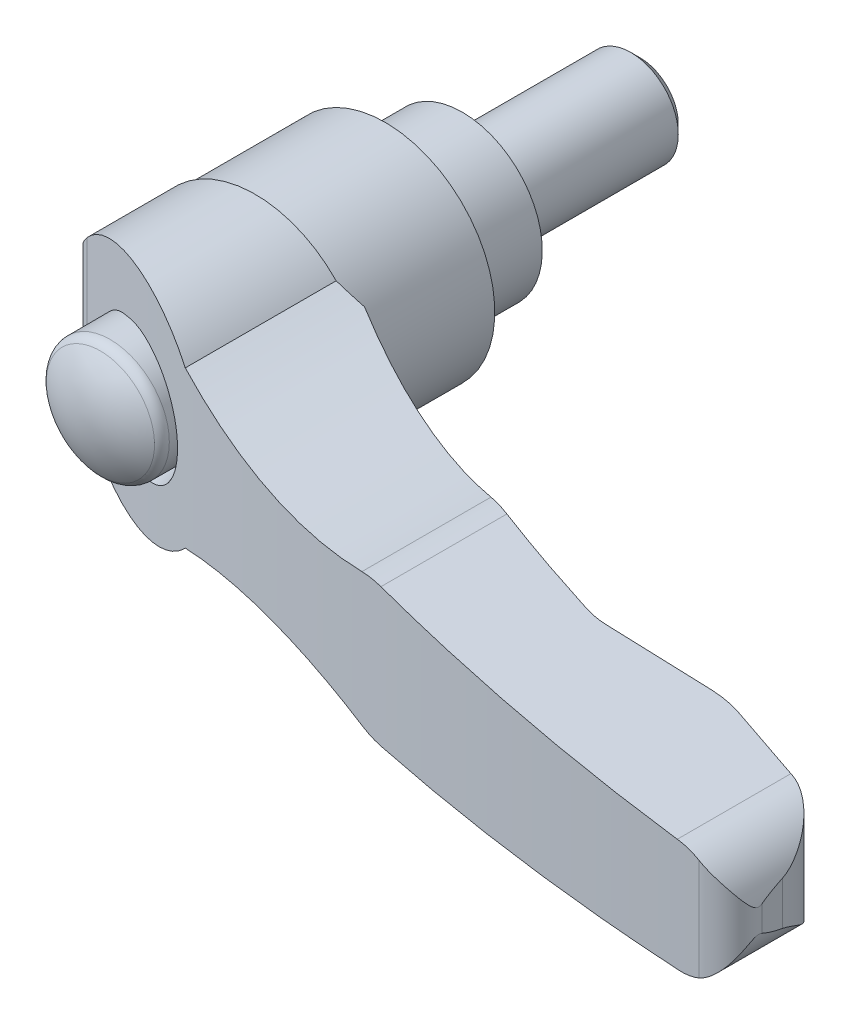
ISO-10303-21;
HEADER;
FILE_DESCRIPTION(('STEP AP214'),'2;1');
FILE_NAME('part.step','',(''),(''),'','','');
FILE_SCHEMA(('AUTOMOTIVE_DESIGN { 1 0 10303 214 1 1 1 1 }'));
ENDSEC;
DATA;
#1=APPLICATION_CONTEXT('core data for automotive mechanical design processes');
#2=APPLICATION_PROTOCOL_DEFINITION('international standard','automotive_design',2000,#1);
#3=PRODUCT_CONTEXT('',#1,'mechanical');
#4=PRODUCT('Part','Part','',(#3));
#5=PRODUCT_RELATED_PRODUCT_CATEGORY('part','',(#4));
#6=PRODUCT_DEFINITION_FORMATION('','',#4);
#7=PRODUCT_DEFINITION_CONTEXT('part definition',#1,'design');
#8=PRODUCT_DEFINITION('design','',#6,#7);
#9=PRODUCT_DEFINITION_SHAPE('','',#8);
#10=(LENGTH_UNIT() NAMED_UNIT(*) SI_UNIT(.MILLI.,.METRE.));
#11=(NAMED_UNIT(*) PLANE_ANGLE_UNIT() SI_UNIT($,.RADIAN.));
#12=(NAMED_UNIT(*) SI_UNIT($,.STERADIAN.) SOLID_ANGLE_UNIT());
#13=UNCERTAINTY_MEASURE_WITH_UNIT(LENGTH_MEASURE(1.E-05),#10,'distance_accuracy_value','');
#14=(GEOMETRIC_REPRESENTATION_CONTEXT(3) GLOBAL_UNCERTAINTY_ASSIGNED_CONTEXT((#13)) GLOBAL_UNIT_ASSIGNED_CONTEXT((#10,
#11,#12)) REPRESENTATION_CONTEXT('',''));
#15=CARTESIAN_POINT('',(0.,0.,0.));
#16=DIRECTION('',(0.,0.,1.));
#17=DIRECTION('',(1.,0.,0.));
#18=AXIS2_PLACEMENT_3D('',#15,#16,#17);
#19=CARTESIAN_POINT('',(1.6165,0.,-15.));
#20=DIRECTION('',(0.,0.,-1.));
#21=DIRECTION('',(0.,1.,0.));
#22=AXIS2_PLACEMENT_3D('',#19,#20,#21);
#23=PLANE('',#22);
#24=CARTESIAN_POINT('',(0.,0.,-15.0000000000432));
#25=DIRECTION('',(0.,0.,1.));
#26=DIRECTION('',(0.,-1.,0.));
#27=AXIS2_PLACEMENT_3D('',#24,#25,#26);
#28=CIRCLE('',#27,3.23299999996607);
#29=CARTESIAN_POINT('',(0.,-3.23299999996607,-15.0000000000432));
#30=VERTEX_POINT('',#29);
#31=EDGE_CURVE('E17',#30,#30,#28,.T.);
#32=ORIENTED_EDGE('',*,*,#31,.F.);
#33=EDGE_LOOP('',(#32));
#34=FACE_BOUND('',#33,.T.);
#35=ADVANCED_FACE('F14',(#34),#23,.T.);
#36=CARTESIAN_POINT('',(0.,0.,-14.233000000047));
#37=DIRECTION('',(0.,0.,1.));
#38=DIRECTION('',(0.,-1.,0.));
#39=AXIS2_PLACEMENT_3D('',#36,#37,#38);
#40=CONICAL_SURFACE('',#39,4.0000000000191,0.785398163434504);
#41=CARTESIAN_POINT('',(0.,0.,-14.233));
#42=DIRECTION('',(0.,0.,-1.));
#43=DIRECTION('',(0.,1.,0.));
#44=AXIS2_PLACEMENT_3D('',#41,#42,#43);
#45=CIRCLE('',#44,4.);
#46=CARTESIAN_POINT('',(0.,4.,-14.233));
#47=VERTEX_POINT('',#46);
#48=EDGE_CURVE('E196',#47,#47,#45,.F.);
#49=ORIENTED_EDGE('',*,*,#48,.F.);
#50=EDGE_LOOP('',(#49));
#51=FACE_BOUND('',#50,.T.);
#52=ORIENTED_EDGE('',*,*,#31,.T.);
#53=EDGE_LOOP('',(#52));
#54=FACE_BOUND('',#53,.T.);
#55=ADVANCED_FACE('F449',(#51,#54),#40,.T.);
#56=CARTESIAN_POINT('',(0.,0.,-7.1165));
#57=DIRECTION('',(0.,0.,-1.));
#58=DIRECTION('',(0.,1.,0.));
#59=AXIS2_PLACEMENT_3D('',#56,#57,#58);
#60=CYLINDRICAL_SURFACE('',#59,4.);
#61=CARTESIAN_POINT('',(0.,0.,0.));
#62=DIRECTION('',(0.,0.,-1.));
#63=DIRECTION('',(0.,1.,0.));
#64=AXIS2_PLACEMENT_3D('',#61,#62,#63);
#65=CIRCLE('',#64,4.);
#66=CARTESIAN_POINT('',(0.,4.,0.));
#67=VERTEX_POINT('',#66);
#68=EDGE_CURVE('E198',#67,#67,#65,.F.);
#69=ORIENTED_EDGE('',*,*,#68,.F.);
#70=EDGE_LOOP('',(#69));
#71=FACE_BOUND('',#70,.T.);
#72=ORIENTED_EDGE('',*,*,#48,.T.);
#73=EDGE_LOOP('',(#72));
#74=FACE_BOUND('',#73,.T.);
#75=ADVANCED_FACE('F446',(#71,#74),#60,.T.);
#76=CARTESIAN_POINT('',(5.375,0.,0.));
#77=DIRECTION('',(0.,0.,-1.));
#78=DIRECTION('',(0.,1.,0.));
#79=AXIS2_PLACEMENT_3D('',#76,#77,#78);
#80=PLANE('',#79);
#81=ORIENTED_EDGE('',*,*,#68,.T.);
#82=EDGE_LOOP('',(#81));
#83=FACE_BOUND('',#82,.T.);
#84=CARTESIAN_POINT('',(0.,0.,0.));
#85=DIRECTION('',(0.,0.,-1.));
#86=DIRECTION('',(0.,1.,0.));
#87=AXIS2_PLACEMENT_3D('',#84,#85,#86);
#88=CIRCLE('',#87,6.75);
#89=CARTESIAN_POINT('',(0.,6.75,0.));
#90=VERTEX_POINT('',#89);
#91=EDGE_CURVE('E195',#90,#90,#88,.F.);
#92=ORIENTED_EDGE('',*,*,#91,.F.);
#93=EDGE_LOOP('',(#92));
#94=FACE_BOUND('',#93,.T.);
#95=ADVANCED_FACE('F443',(#83,#94),#80,.T.);
#96=CARTESIAN_POINT('',(0.,0.,8.25));
#97=DIRECTION('',(0.,0.,-1.));
#98=DIRECTION('',(0.,1.,0.));
#99=AXIS2_PLACEMENT_3D('',#96,#97,#98);
#100=CYLINDRICAL_SURFACE('',#99,6.75);
#101=ORIENTED_EDGE('',*,*,#91,.T.);
#102=EDGE_LOOP('',(#101));
#103=FACE_BOUND('',#102,.T.);
#104=CARTESIAN_POINT('',(0.,0.,7.15000000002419));
#105=DIRECTION('',(0.,0.,-1.));
#106=DIRECTION('',(1.,0.,0.));
#107=AXIS2_PLACEMENT_3D('',#104,#105,#106);
#108=CIRCLE('',#107,6.74999999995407);
#109=CARTESIAN_POINT('',(6.74999999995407,0.,7.15000000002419));
#110=VERTEX_POINT('',#109);
#111=EDGE_CURVE('E192',#110,#110,#108,.T.);
#112=ORIENTED_EDGE('',*,*,#111,.T.);
#113=EDGE_LOOP('',(#112));
#114=FACE_BOUND('',#113,.T.);
#115=ADVANCED_FACE('F480',(#103,#114),#100,.T.);
#116=CARTESIAN_POINT('',(0.,0.,6.9000000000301));
#117=DIRECTION('',(0.,0.,-1.));
#118=DIRECTION('',(0.,1.,0.));
#119=AXIS2_PLACEMENT_3D('',#116,#117,#118);
#120=CONICAL_SURFACE('',#119,7.000000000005,0.785398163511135);
#121=ORIENTED_EDGE('',*,*,#111,.F.);
#122=EDGE_LOOP('',(#121));
#123=FACE_BOUND('',#122,.T.);
#124=CARTESIAN_POINT('',(0.,0.,6.9));
#125=DIRECTION('',(0.,0.,-1.));
#126=DIRECTION('',(0.,1.,0.));
#127=AXIS2_PLACEMENT_3D('',#124,#125,#126);
#128=CIRCLE('',#127,7.);
#129=CARTESIAN_POINT('',(0.,7.,6.9));
#130=VERTEX_POINT('',#129);
#131=EDGE_CURVE('E184',#130,#130,#128,.T.);
#132=ORIENTED_EDGE('',*,*,#131,.T.);
#133=EDGE_LOOP('',(#132));
#134=FACE_BOUND('',#133,.T.);
#135=ADVANCED_FACE('F488',(#123,#134),#120,.F.);
#136=CARTESIAN_POINT('',(0.,0.,6.2));
#137=DIRECTION('',(0.,0.,-1.));
#138=DIRECTION('',(0.,1.,0.));
#139=AXIS2_PLACEMENT_3D('',#136,#137,#138);
#140=CYLINDRICAL_SURFACE('',#139,7.);
#141=ORIENTED_EDGE('',*,*,#131,.F.);
#142=EDGE_LOOP('',(#141));
#143=FACE_BOUND('',#142,.T.);
#144=CARTESIAN_POINT('',(0.,0.,6.5));
#145=DIRECTION('',(0.,0.,-1.));
#146=DIRECTION('',(0.,1.,0.));
#147=AXIS2_PLACEMENT_3D('',#144,#145,#146);
#148=CIRCLE('',#147,7.);
#149=CARTESIAN_POINT('',(0.,7.,6.5));
#150=VERTEX_POINT('',#149);
#151=EDGE_CURVE('E181',#150,#150,#148,.F.);
#152=ORIENTED_EDGE('',*,*,#151,.F.);
#153=EDGE_LOOP('',(#152));
#154=FACE_BOUND('',#153,.T.);
#155=ADVANCED_FACE('F497',(#143,#154),#140,.F.);
#156=CARTESIAN_POINT('',(-9.01003775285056,-19.,6.5));
#157=DIRECTION('',(0.707106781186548,0.,0.707106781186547));
#158=DIRECTION('',(-0.707106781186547,0.,0.707106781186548));
#159=AXIS2_PLACEMENT_3D('',#156,#157,#158);
#160=PLANE('',#159);
#161=DIRECTION('',(0.,1.,0.));
#162=VECTOR('',#161,1.);
#163=CARTESIAN_POINT('',(-9.01003775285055,0.,6.5));
#164=LINE('',#163,#162);
#165=CARTESIAN_POINT('',(-9.01003775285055,-2.13584185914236,6.5));
#166=VERTEX_POINT('',#165);
#167=CARTESIAN_POINT('',(-9.01003775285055,2.13584185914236,6.5));
#168=VERTEX_POINT('',#167);
#169=EDGE_CURVE('E165',#166,#168,#164,.T.);
#170=ORIENTED_EDGE('',*,*,#169,.F.);
#171=CARTESIAN_POINT('',(-0.00999999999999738,0.,-2.50003775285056));
#172=DIRECTION('',(0.707106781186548,0.,0.707106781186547));
#173=DIRECTION('',(-0.707106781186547,0.,0.707106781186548));
#174=AXIS2_PLACEMENT_3D('',#171,#172,#173);
#175=ELLIPSE('',#174,13.0814754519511,9.25);
#176=EDGE_CURVE('E168',#168,#166,#175,.T.);
#177=ORIENTED_EDGE('',*,*,#176,.F.);
#178=EDGE_LOOP('',(#170,#177));
#179=FACE_BOUND('',#178,.T.);
#180=ADVANCED_FACE('F170',(#179),#160,.F.);
#181=CARTESIAN_POINT('',(-4.635,0.,6.5));
#182=DIRECTION('',(0.,0.,-1.));
#183=DIRECTION('',(0.,1.,0.));
#184=AXIS2_PLACEMENT_3D('',#181,#182,#183);
#185=PLANE('',#184);
#186=ORIENTED_EDGE('',*,*,#169,.T.);
#187=CARTESIAN_POINT('',(-0.00999999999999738,0.,6.5));
#188=DIRECTION('',(0.,0.,1.));
#189=DIRECTION('',(-1.,0.,0.));
#190=AXIS2_PLACEMENT_3D('',#187,#188,#189);
#191=CIRCLE('',#190,9.25);
#192=EDGE_CURVE('E172',#166,#168,#191,.T.);
#193=ORIENTED_EDGE('',*,*,#192,.F.);
#194=EDGE_LOOP('',(#186,#193));
#195=FACE_BOUND('',#194,.T.);
#196=ORIENTED_EDGE('',*,*,#151,.T.);
#197=EDGE_LOOP('',(#196));
#198=FACE_BOUND('',#197,.T.);
#199=ADVANCED_FACE('F179',(#195,#198),#185,.T.);
#200=CARTESIAN_POINT('',(-0.00999999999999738,0.,13.5625));
#201=DIRECTION('',(0.,0.,1.));
#202=DIRECTION('',(-1.,0.,0.));
#203=AXIS2_PLACEMENT_3D('',#200,#201,#202);
#204=CYLINDRICAL_SURFACE('',#203,9.25);
#205=ORIENTED_EDGE('',*,*,#192,.T.);
#206=ORIENTED_EDGE('',*,*,#176,.T.);
#207=EDGE_LOOP('',(#205,#206));
#208=FACE_BOUND('',#207,.T.);
#209=CARTESIAN_POINT('',(-0.00999999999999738,0.,17.5));
#210=DIRECTION('',(0.,0.,1.));
#211=DIRECTION('',(-1.,0.,0.));
#212=AXIS2_PLACEMENT_3D('',#209,#210,#211);
#213=CIRCLE('',#212,9.25);
#214=CARTESIAN_POINT('',(-9.26,0.,17.5));
#215=VERTEX_POINT('',#214);
#216=CARTESIAN_POINT('',(9.23999999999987,0.,17.5000000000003));
#217=VERTEX_POINT('',#216);
#218=EDGE_CURVE('E420',#215,#217,#213,.T.);
#219=ORIENTED_EDGE('',*,*,#218,.F.);
#220=CARTESIAN_POINT('',(-0.00999999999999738,0.,17.5));
#221=DIRECTION('',(0.,0.,1.));
#222=DIRECTION('',(-1.,0.,0.));
#223=AXIS2_PLACEMENT_3D('',#220,#221,#222);
#224=CIRCLE('',#223,9.25);
#225=EDGE_CURVE('E429',#217,#215,#224,.T.);
#226=ORIENTED_EDGE('',*,*,#225,.F.);
#227=EDGE_LOOP('',(#219,#226));
#228=FACE_BOUND('',#227,.T.);
#229=ADVANCED_FACE('F174',(#208,#228),#204,.T.);
#230=CARTESIAN_POINT('',(0.,0.,24.));
#231=DIRECTION('',(1.,0.,0.));
#232=DIRECTION('',(0.,0.,1.));
#233=AXIS2_PLACEMENT_3D('',#230,#231,#232);
#234=SPHERICAL_SURFACE('',#233,8.);
#235=CARTESIAN_POINT('',(0.,0.,30.5652144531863));
#236=DIRECTION('',(0.,0.,1.));
#237=DIRECTION('',(0.,-1.,0.));
#238=AXIS2_PLACEMENT_3D('',#235,#236,#237);
#239=CIRCLE('',#238,4.57142857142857);
#240=CARTESIAN_POINT('',(0.,-4.57142857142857,30.5652144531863));
#241=VERTEX_POINT('',#240);
#242=EDGE_CURVE('E404',#241,#241,#239,.F.);
#243=ORIENTED_EDGE('',*,*,#242,.F.);
#244=EDGE_LOOP('',(#243));
#245=FACE_BOUND('',#244,.T.);
#246=ADVANCED_FACE('F528',(#245),#234,.T.);
#247=CARTESIAN_POINT('',(64.6274051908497,-10.5,37.5817950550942));
#248=DIRECTION('',(0.992331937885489,0.,-0.123601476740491));
#249=DIRECTION('',(0.123601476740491,0.,0.992331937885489));
#250=AXIS2_PLACEMENT_3D('',#247,#248,#249);
#251=PLANE('',#250);
#252=CARTESIAN_POINT('',(60.25,0.,2.43788666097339));
#253=DIRECTION('',(0.992331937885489,0.,-0.123601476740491));
#254=DIRECTION('',(0.123601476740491,0.,0.992331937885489));
#255=AXIS2_PLACEMENT_3D('',#252,#253,#254);
#256=ELLIPSE('',#255,38.4299615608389,4.75);
#257=CARTESIAN_POINT('',(64.8745408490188,1.08449155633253,39.5659186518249));
#258=VERTEX_POINT('',#257);
#259=CARTESIAN_POINT('',(64.6274051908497,1.84413226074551,37.5817950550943));
#260=VERTEX_POINT('',#259);
#261=EDGE_CURVE('E838',#258,#260,#256,.F.);
#262=ORIENTED_EDGE('',*,*,#261,.F.);
#263=DIRECTION('',(0.,-1.,0.));
#264=VECTOR('',#263,1.);
#265=CARTESIAN_POINT('',(64.8745408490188,-10.5,39.5659186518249));
#266=LINE('',#265,#264);
#267=CARTESIAN_POINT('',(64.8745408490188,-1.08449155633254,39.5659186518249));
#268=VERTEX_POINT('',#267);
#269=EDGE_CURVE('E793',#268,#258,#266,.F.);
#270=ORIENTED_EDGE('',*,*,#269,.F.);
#271=CARTESIAN_POINT('',(60.25,0.,2.43788666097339));
#272=DIRECTION('',(0.992331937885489,0.,-0.123601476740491));
#273=DIRECTION('',(0.123601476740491,0.,0.992331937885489));
#274=AXIS2_PLACEMENT_3D('',#271,#272,#273);
#275=ELLIPSE('',#274,38.4299615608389,4.75);
#276=CARTESIAN_POINT('',(64.6274051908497,-1.84413226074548,37.5817950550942));
#277=VERTEX_POINT('',#276);
#278=EDGE_CURVE('E801',#277,#268,#275,.F.);
#279=ORIENTED_EDGE('',*,*,#278,.F.);
#280=DIRECTION('',(0.,-1.,0.));
#281=VECTOR('',#280,1.);
#282=CARTESIAN_POINT('',(64.6274051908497,-10.5,37.5817950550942));
#283=LINE('',#282,#281);
#284=EDGE_CURVE('E177',#260,#277,#283,.T.);
#285=ORIENTED_EDGE('',*,*,#284,.F.);
#286=EDGE_LOOP('',(#262,#270,#279,#285));
#287=FACE_BOUND('',#286,.T.);
#288=ADVANCED_FACE('F536',(#287),#251,.T.);
#289=CARTESIAN_POINT('',(58.6337202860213,-10.5,38.3283479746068));
#290=DIRECTION('',(0.,-1.,0.));
#291=DIRECTION('',(1.,0.,0.));
#292=AXIS2_PLACEMENT_3D('',#289,#290,#291);
#293=CYLINDRICAL_SURFACE('',#292,6.04);
#294=CARTESIAN_POINT('',(64.6274051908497,1.84413226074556,37.5817950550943));
#295=CARTESIAN_POINT('',(64.6175868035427,1.86745330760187,37.5030045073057));
#296=CARTESIAN_POINT('',(64.6063375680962,1.89362327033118,37.4253204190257));
#297=CARTESIAN_POINT('',(64.5811702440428,1.95049016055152,37.2721928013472));
#298=CARTESIAN_POINT('',(64.5672561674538,1.98118026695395,37.196746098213));
#299=CARTESIAN_POINT('',(64.5369883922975,2.04585034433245,37.0482136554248));
#300=CARTESIAN_POINT('',(64.520645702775,2.07981523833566,36.9751189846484));
#301=CARTESIAN_POINT('',(64.4855821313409,2.15032519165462,36.8307396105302));
#302=CARTESIAN_POINT('',(64.4668602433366,2.18687133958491,36.7594556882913));
#303=CARTESIAN_POINT('',(64.4072221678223,2.29938724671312,36.547961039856));
#304=CARTESIAN_POINT('',(64.3628565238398,2.37818379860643,36.410218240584));
#305=CARTESIAN_POINT('',(64.2652007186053,2.53960895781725,36.1400450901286));
#306=CARTESIAN_POINT('',(64.2118976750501,2.6222429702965,36.007622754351));
#307=CARTESIAN_POINT('',(64.077119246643,2.81672317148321,35.7040219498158));
#308=CARTESIAN_POINT('',(63.9921849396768,2.92909268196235,35.5347005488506));
#309=CARTESIAN_POINT('',(63.8063278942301,3.15216626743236,35.2039790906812));
#310=CARTESIAN_POINT('',(63.7054078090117,3.26287061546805,35.0425777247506));
#311=CARTESIAN_POINT('',(63.4870671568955,3.47959027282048,34.7278934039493));
#312=CARTESIAN_POINT('',(63.369645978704,3.58560540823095,34.5746107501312));
#313=CARTESIAN_POINT('',(63.1179209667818,3.7899652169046,34.277236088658));
#314=CARTESIAN_POINT('',(62.9836257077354,3.88831374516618,34.1331394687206));
#315=CARTESIAN_POINT('',(62.6561598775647,4.10136712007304,33.815313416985));
#316=CARTESIAN_POINT('',(62.4571888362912,4.2125890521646,33.6450495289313));
#317=CARTESIAN_POINT('',(62.1378586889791,4.36029911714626,33.4069452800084));
#318=CARTESIAN_POINT('',(62.0281124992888,4.40629516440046,33.330558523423));
#319=CARTESIAN_POINT('',(61.8018114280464,4.49098569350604,33.1841350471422));
#320=CARTESIAN_POINT('',(61.6852609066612,4.52968478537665,33.1140943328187));
#321=CARTESIAN_POINT('',(61.4786111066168,4.58924867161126,32.9993621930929));
#322=CARTESIAN_POINT('',(61.3900115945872,4.61209493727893,32.9529824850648));
#323=CARTESIAN_POINT('',(61.209734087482,4.65295056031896,32.8642982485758));
#324=CARTESIAN_POINT('',(61.1180570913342,4.67096147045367,32.82199241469));
#325=CARTESIAN_POINT('',(60.9313596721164,4.70183469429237,32.7415027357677));
#326=CARTESIAN_POINT('',(60.8363219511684,4.71466416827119,32.7033462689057));
#327=CARTESIAN_POINT('',(60.6438287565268,4.73463763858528,32.631712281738));
#328=CARTESIAN_POINT('',(60.5463713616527,4.74177695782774,32.5982386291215));
#329=CARTESIAN_POINT('',(60.4479724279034,4.74587261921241,32.5672639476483));
#330=B_SPLINE_CURVE_WITH_KNOTS('',3,(#294,#295,#296,#297,#298,#299,#300,#301,#302,#303,#304,
#305,#306,#307,#308,#309,#310,#311,#312,#313,#314,#315,#316,#317,#318,#319,#320,#321,#322,#323,
#324,#325,#326,#327,#328,#329),.UNSPECIFIED.,.F.,.F.,(4,2,2,2,2,2,2,2,2,2,2,2,2,2,2,2,2,4),(0.,
0.248076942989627,0.495783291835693,0.742399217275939,0.989119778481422,1.48293160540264,
1.97746142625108,2.63745339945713,3.29733594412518,3.95724294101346,4.61681594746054,
5.46693586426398,5.89075482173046,6.31430511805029,6.62183365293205,6.92926331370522,
7.23861197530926,7.54821464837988),.UNSPECIFIED.);
#331=CARTESIAN_POINT('',(60.4479724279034,4.74587261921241,32.5672639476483));
#332=VERTEX_POINT('',#331);
#333=EDGE_CURVE('E792',#260,#332,#330,.T.);
#334=ORIENTED_EDGE('',*,*,#333,.F.);
#335=ORIENTED_EDGE('',*,*,#284,.T.);
#336=CARTESIAN_POINT('',(60.4479724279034,-4.74587261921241,32.5672639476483));
#337=CARTESIAN_POINT('',(60.5755504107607,-4.74057354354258,32.6074069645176));
#338=CARTESIAN_POINT('',(60.7015088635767,-4.73014540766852,32.6517620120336));
#339=CARTESIAN_POINT('',(60.9490652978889,-4.69992242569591,32.7481786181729));
#340=CARTESIAN_POINT('',(61.0706698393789,-4.6801423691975,32.8002279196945));
#341=CARTESIAN_POINT('',(61.3074659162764,-4.63235500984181,32.9108206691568));
#342=CARTESIAN_POINT('',(61.4227141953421,-4.60444273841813,32.9692844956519));
#343=CARTESIAN_POINT('',(61.6477173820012,-4.54120548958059,33.0925213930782));
#344=CARTESIAN_POINT('',(61.7574696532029,-4.50587699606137,33.1572974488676));
#345=CARTESIAN_POINT('',(61.9940137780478,-4.42040174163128,33.307032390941));
#346=CARTESIAN_POINT('',(62.1193938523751,-4.36870213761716,33.3933358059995));
#347=CARTESIAN_POINT('',(62.3610721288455,-4.25718277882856,33.5732278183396));
#348=CARTESIAN_POINT('',(62.4773638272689,-4.19735729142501,33.6668215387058));
#349=CARTESIAN_POINT('',(62.7012840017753,-4.07066877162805,33.8608437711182));
#350=CARTESIAN_POINT('',(62.8088611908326,-4.00376876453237,33.9613071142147));
#351=CARTESIAN_POINT('',(63.0146476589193,-3.86453813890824,34.1677809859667));
#352=CARTESIAN_POINT('',(63.1128596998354,-3.79220913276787,34.2737898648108));
#353=CARTESIAN_POINT('',(63.3331746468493,-3.6170051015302,34.5290929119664));
#354=CARTESIAN_POINT('',(63.4514763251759,-3.51235864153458,34.6804594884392));
#355=CARTESIAN_POINT('',(63.6718053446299,-3.29808480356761,34.9913387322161));
#356=CARTESIAN_POINT('',(63.7738256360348,-3.18845529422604,35.1508548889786));
#357=CARTESIAN_POINT('',(63.961662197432,-2.96765680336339,35.4770445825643));
#358=CARTESIAN_POINT('',(64.0475378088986,-2.85649513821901,35.6436890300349));
#359=CARTESIAN_POINT('',(64.2038484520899,-2.63586419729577,35.9851508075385));
#360=CARTESIAN_POINT('',(64.2742871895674,-2.52639452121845,36.1599661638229));
#361=CARTESIAN_POINT('',(64.3705847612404,-2.36382517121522,36.4361542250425));
#362=CARTESIAN_POINT('',(64.4019853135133,-2.30809068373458,36.5340606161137));
#363=CARTESIAN_POINT('',(64.4601539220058,-2.20019362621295,36.7330390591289));
#364=CARTESIAN_POINT('',(64.4869269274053,-2.14802727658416,36.8341075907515));
#365=CARTESIAN_POINT('',(64.5357331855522,-2.0489078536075,37.0402846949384));
#366=CARTESIAN_POINT('',(64.5577546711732,-2.00196785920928,37.1454025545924));
#367=CARTESIAN_POINT('',(64.5966140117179,-1.91618262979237,37.360168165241));
#368=CARTESIAN_POINT('',(64.6134353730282,-1.87736327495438,37.4698291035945));
#369=CARTESIAN_POINT('',(64.6274051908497,-1.84413226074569,37.5817950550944));
#370=B_SPLINE_CURVE_WITH_KNOTS('',3,(#336,#337,#338,#339,#340,#341,#342,#343,#344,#345,#346,
#347,#348,#349,#350,#351,#352,#353,#354,#355,#356,#357,#358,#359,#360,#361,#362,#363,#364,#365,
#366,#367,#368,#369),.UNSPECIFIED.,.F.,.F.,(4,2,2,2,2,2,2,2,2,2,2,2,2,2,2,2,4),(0.,
0.401264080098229,0.801895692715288,1.19802151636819,1.5943355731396,2.07588331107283,
2.55777255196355,3.04231807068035,3.52672024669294,4.18208013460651,4.83772302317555,
5.49090678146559,6.14393356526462,6.4946438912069,6.84497677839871,7.19616755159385,
7.54846105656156),.UNSPECIFIED.);
#371=CARTESIAN_POINT('',(60.4479724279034,-4.74587261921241,32.5672639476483));
#372=VERTEX_POINT('',#371);
#373=EDGE_CURVE('E804',#372,#277,#370,.T.);
#374=ORIENTED_EDGE('',*,*,#373,.F.);
#375=DIRECTION('',(0.,-1.,0.));
#376=VECTOR('',#375,1.);
#377=CARTESIAN_POINT('',(60.4479724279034,-10.5,32.5672639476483));
#378=LINE('',#377,#376);
#379=EDGE_CURVE('E418',#332,#372,#378,.T.);
#380=ORIENTED_EDGE('',*,*,#379,.F.);
#381=EDGE_LOOP('',(#334,#335,#374,#380));
#382=FACE_BOUND('',#381,.T.);
#383=ADVANCED_FACE('F545',(#382),#293,.T.);
#384=CARTESIAN_POINT('',(-9.26,-10.5,17.5));
#385=DIRECTION('',(0.,0.,-1.));
#386=DIRECTION('',(0.,1.,0.));
#387=AXIS2_PLACEMENT_3D('',#384,#385,#386);
#388=PLANE('',#387);
#389=DIRECTION('',(0.,-1.,0.));
#390=VECTOR('',#389,1.);
#391=CARTESIAN_POINT('',(-9.26,-10.5,17.5));
#392=LINE('',#391,#390);
#393=CARTESIAN_POINT('',(-9.26,2.12188595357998,17.5));
#394=VERTEX_POINT('',#393);
#395=EDGE_CURVE('E427',#394,#215,#392,.T.);
#396=ORIENTED_EDGE('',*,*,#395,.F.);
#397=CARTESIAN_POINT('',(0.,0.,17.5));
#398=DIRECTION('',(0.,0.,1.));
#399=DIRECTION('',(0.,-1.,0.));
#400=AXIS2_PLACEMENT_3D('',#397,#398,#399);
#401=CIRCLE('',#400,9.5);
#402=CARTESIAN_POINT('',(6.8437408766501,6.58887022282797,17.5));
#403=VERTEX_POINT('',#402);
#404=EDGE_CURVE('E341',#403,#394,#401,.T.);
#405=ORIENTED_EDGE('',*,*,#404,.F.);
#406=CARTESIAN_POINT('',(19.25,44.09,17.5));
#407=DIRECTION('',(0.,0.,1.));
#408=DIRECTION('',(0.,-1.,0.));
#409=AXIS2_PLACEMENT_3D('',#406,#407,#408);
#410=CIRCLE('',#409,39.5);
#411=CARTESIAN_POINT('',(9.23999999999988,5.8794006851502,17.5000000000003));
#412=VERTEX_POINT('',#411);
#413=EDGE_CURVE('E301',#403,#412,#410,.T.);
#414=ORIENTED_EDGE('',*,*,#413,.T.);
#415=DIRECTION('',(0.,-1.,0.));
#416=VECTOR('',#415,1.);
#417=CARTESIAN_POINT('',(9.23999999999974,-10.5,17.5000000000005));
#418=LINE('',#417,#416);
#419=EDGE_CURVE('E407',#412,#217,#418,.T.);
#420=ORIENTED_EDGE('',*,*,#419,.T.);
#421=ORIENTED_EDGE('',*,*,#225,.T.);
#422=EDGE_LOOP('',(#396,#405,#414,#420,#421));
#423=FACE_BOUND('',#422,.T.);
#424=ADVANCED_FACE('F554',(#423),#388,.T.);
#425=CARTESIAN_POINT('',(-9.26,-10.5,21.2038249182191));
#426=DIRECTION('',(-1.,0.,0.));
#427=DIRECTION('',(0.,-1.,0.));
#428=AXIS2_PLACEMENT_3D('',#425,#426,#427);
#429=PLANE('',#428);
#430=ORIENTED_EDGE('',*,*,#395,.T.);
#431=DIRECTION('',(0.,1.,0.));
#432=VECTOR('',#431,1.);
#433=CARTESIAN_POINT('',(-9.26,-10.5,17.5));
#434=LINE('',#433,#432);
#435=CARTESIAN_POINT('',(-9.26,-2.12188595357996,17.5));
#436=VERTEX_POINT('',#435);
#437=EDGE_CURVE('E421',#436,#215,#434,.T.);
#438=ORIENTED_EDGE('',*,*,#437,.F.);
#439=DIRECTION('',(0.,0.,1.));
#440=VECTOR('',#439,1.);
#441=CARTESIAN_POINT('',(-9.26,-2.12188595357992,42.5));
#442=LINE('',#441,#440);
#443=CARTESIAN_POINT('',(-9.26,-2.12188595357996,21.2038249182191));
#444=VERTEX_POINT('',#443);
#445=EDGE_CURVE('E424',#444,#436,#442,.F.);
#446=ORIENTED_EDGE('',*,*,#445,.F.);
#447=DIRECTION('',(0.,-1.,0.));
#448=VECTOR('',#447,1.);
#449=CARTESIAN_POINT('',(-9.26,-10.5,21.2038249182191));
#450=LINE('',#449,#448);
#451=CARTESIAN_POINT('',(-9.26,2.12188595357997,21.2038249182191));
#452=VERTEX_POINT('',#451);
#453=EDGE_CURVE('E765',#452,#444,#450,.T.);
#454=ORIENTED_EDGE('',*,*,#453,.F.);
#455=DIRECTION('',(0.,0.,1.));
#456=VECTOR('',#455,1.);
#457=CARTESIAN_POINT('',(-9.26,2.12188595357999,42.5));
#458=LINE('',#457,#456);
#459=EDGE_CURVE('E344',#394,#452,#458,.T.);
#460=ORIENTED_EDGE('',*,*,#459,.F.);
#461=EDGE_LOOP('',(#430,#438,#446,#454,#460));
#462=FACE_BOUND('',#461,.T.);
#463=ADVANCED_FACE('F562',(#462),#429,.T.);
#464=CARTESIAN_POINT('',(-9.26,-10.5,17.5));
#465=DIRECTION('',(0.,0.,-1.));
#466=DIRECTION('',(0.,1.,0.));
#467=AXIS2_PLACEMENT_3D('',#464,#465,#466);
#468=PLANE('',#467);
#469=DIRECTION('',(0.,-1.,0.));
#470=VECTOR('',#469,1.);
#471=CARTESIAN_POINT('',(9.23999999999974,-10.5,17.5000000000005));
#472=LINE('',#471,#470);
#473=CARTESIAN_POINT('',(9.23999999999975,-5.87940068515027,17.5000000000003));
#474=VERTEX_POINT('',#473);
#475=EDGE_CURVE('E405',#217,#474,#472,.T.);
#476=ORIENTED_EDGE('',*,*,#475,.T.);
#477=CARTESIAN_POINT('',(19.25,-44.09,17.5));
#478=DIRECTION('',(0.,0.,1.));
#479=DIRECTION('',(0.,-1.,0.));
#480=AXIS2_PLACEMENT_3D('',#477,#478,#479);
#481=CIRCLE('',#480,39.5);
#482=CARTESIAN_POINT('',(6.84374087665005,-6.588870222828,17.5));
#483=VERTEX_POINT('',#482);
#484=EDGE_CURVE('E881',#474,#483,#481,.T.);
#485=ORIENTED_EDGE('',*,*,#484,.T.);
#486=CARTESIAN_POINT('',(0.,0.,17.5));
#487=DIRECTION('',(0.,0.,1.));
#488=DIRECTION('',(0.,-1.,0.));
#489=AXIS2_PLACEMENT_3D('',#486,#487,#488);
#490=CIRCLE('',#489,9.5);
#491=EDGE_CURVE('E770',#436,#483,#490,.T.);
#492=ORIENTED_EDGE('',*,*,#491,.F.);
#493=ORIENTED_EDGE('',*,*,#437,.T.);
#494=ORIENTED_EDGE('',*,*,#218,.T.);
#495=EDGE_LOOP('',(#476,#485,#492,#493,#494));
#496=FACE_BOUND('',#495,.T.);
#497=ADVANCED_FACE('F570',(#496),#468,.T.);
#498=CARTESIAN_POINT('',(53.8294507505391,-10.5,30.4829917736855));
#499=DIRECTION('',(0.300372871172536,0.,-0.953821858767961));
#500=DIRECTION('',(0.953821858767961,0.,0.300372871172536));
#501=AXIS2_PLACEMENT_3D('',#498,#499,#500);
#502=PLANE('',#501);
#503=CARTESIAN_POINT('',(60.25,0.,32.5049194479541));
#504=DIRECTION('',(0.300372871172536,0.,-0.953821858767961));
#505=DIRECTION('',(0.953821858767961,0.,0.300372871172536));
#506=AXIS2_PLACEMENT_3D('',#503,#504,#505);
#507=ELLIPSE('',#506,4.97996555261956,4.75);
#508=CARTESIAN_POINT('',(60.25,4.75,32.5049194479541));
#509=VERTEX_POINT('',#508);
#510=EDGE_CURVE('E794',#332,#509,#507,.F.);
#511=ORIENTED_EDGE('',*,*,#510,.F.);
#512=ORIENTED_EDGE('',*,*,#379,.T.);
#513=CARTESIAN_POINT('',(60.25,0.,32.5049194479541));
#514=DIRECTION('',(0.300372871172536,0.,-0.953821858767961));
#515=DIRECTION('',(0.953821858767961,0.,0.300372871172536));
#516=AXIS2_PLACEMENT_3D('',#513,#514,#515);
#517=ELLIPSE('',#516,4.97996555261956,4.75);
#518=CARTESIAN_POINT('',(60.25,-4.75,32.5049194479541));
#519=VERTEX_POINT('',#518);
#520=EDGE_CURVE('E827',#519,#372,#517,.F.);
#521=ORIENTED_EDGE('',*,*,#520,.F.);
#522=DIRECTION('',(-0.953255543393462,-0.0344545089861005,-0.300194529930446));
#523=VECTOR('',#522,1.);
#524=CARTESIAN_POINT('',(60.25,-4.75,32.5049194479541));
#525=LINE('',#524,#523);
#526=CARTESIAN_POINT('',(53.8294507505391,-4.98206460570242,30.4829917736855));
#527=VERTEX_POINT('',#526);
#528=EDGE_CURVE('E873',#519,#527,#525,.T.);
#529=ORIENTED_EDGE('',*,*,#528,.T.);
#530=DIRECTION('',(0.,-1.,0.));
#531=VECTOR('',#530,1.);
#532=CARTESIAN_POINT('',(53.8294507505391,-10.5,30.4829917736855));
#533=LINE('',#532,#531);
#534=CARTESIAN_POINT('',(53.8294507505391,4.98206460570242,30.4829917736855));
#535=VERTEX_POINT('',#534);
#536=EDGE_CURVE('E415',#535,#527,#533,.T.);
#537=ORIENTED_EDGE('',*,*,#536,.F.);
#538=DIRECTION('',(0.953255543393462,-0.0344545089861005,0.300194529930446));
#539=VECTOR('',#538,1.);
#540=CARTESIAN_POINT('',(53.8294507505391,4.98206460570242,30.4829917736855));
#541=LINE('',#540,#539);
#542=EDGE_CURVE('E300',#535,#509,#541,.T.);
#543=ORIENTED_EDGE('',*,*,#542,.T.);
#544=EDGE_LOOP('',(#511,#512,#521,#529,#537,#543));
#545=FACE_BOUND('',#544,.T.);
#546=ADVANCED_FACE('F579',(#545),#502,.T.);
#547=CARTESIAN_POINT('',(51.0780352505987,-10.5,39.22));
#548=DIRECTION('',(0.,-1.,0.));
#549=DIRECTION('',(1.,0.,0.));
#550=AXIS2_PLACEMENT_3D('',#547,#548,#549);
#551=CYLINDRICAL_SURFACE('',#550,9.15999999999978);
#552=CARTESIAN_POINT('',(51.0780352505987,5.08151188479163,39.22));
#553=DIRECTION('',(-0.0361204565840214,-0.999347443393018,0.));
#554=DIRECTION('',(0.999347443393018,-0.0361204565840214,0.));
#555=AXIS2_PLACEMENT_3D('',#552,#553,#554);
#556=ELLIPSE('',#555,9.16598132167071,9.15999999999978);
#557=CARTESIAN_POINT('',(51.0780352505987,5.08151188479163,30.06));
#558=VERTEX_POINT('',#557);
#559=EDGE_CURVE('E303',#558,#535,#556,.T.);
#560=ORIENTED_EDGE('',*,*,#559,.T.);
#561=ORIENTED_EDGE('',*,*,#536,.T.);
#562=CARTESIAN_POINT('',(51.0780352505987,-5.08151188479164,39.22));
#563=DIRECTION('',(-0.0361204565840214,0.999347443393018,0.));
#564=DIRECTION('',(-0.999347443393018,-0.0361204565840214,0.));
#565=AXIS2_PLACEMENT_3D('',#562,#563,#564);
#566=ELLIPSE('',#565,9.16598132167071,9.15999999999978);
#567=CARTESIAN_POINT('',(51.0780352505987,-5.08151188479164,30.06));
#568=VERTEX_POINT('',#567);
#569=EDGE_CURVE('E872',#527,#568,#566,.T.);
#570=ORIENTED_EDGE('',*,*,#569,.T.);
#571=DIRECTION('',(0.,1.,0.));
#572=VECTOR('',#571,1.);
#573=CARTESIAN_POINT('',(51.0780352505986,-10.5,30.06));
#574=LINE('',#573,#572);
#575=EDGE_CURVE('E412',#558,#568,#574,.F.);
#576=ORIENTED_EDGE('',*,*,#575,.F.);
#577=EDGE_LOOP('',(#560,#561,#570,#576));
#578=FACE_BOUND('',#577,.T.);
#579=ADVANCED_FACE('F588',(#578),#551,.T.);
#580=CARTESIAN_POINT('',(42.239481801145,-10.5,30.06));
#581=DIRECTION('',(0.,0.,-1.));
#582=DIRECTION('',(0.,1.,0.));
#583=AXIS2_PLACEMENT_3D('',#580,#581,#582);
#584=PLANE('',#583);
#585=DIRECTION('',(0.999347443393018,-0.0361204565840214,0.));
#586=VECTOR('',#585,1.);
#587=CARTESIAN_POINT('',(30.3472861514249,5.83080496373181,30.06));
#588=LINE('',#587,#586);
#589=CARTESIAN_POINT('',(42.239481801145,5.4009729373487,30.06));
#590=VERTEX_POINT('',#589);
#591=EDGE_CURVE('E786',#590,#558,#588,.T.);
#592=ORIENTED_EDGE('',*,*,#591,.T.);
#593=ORIENTED_EDGE('',*,*,#575,.T.);
#594=DIRECTION('',(-0.999347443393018,-0.0361204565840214,0.));
#595=VECTOR('',#594,1.);
#596=CARTESIAN_POINT('',(60.25,-4.75,30.06));
#597=LINE('',#596,#595);
#598=CARTESIAN_POINT('',(42.239481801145,-5.4009729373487,30.06));
#599=VERTEX_POINT('',#598);
#600=EDGE_CURVE('E869',#568,#599,#597,.T.);
#601=ORIENTED_EDGE('',*,*,#600,.T.);
#602=DIRECTION('',(0.,-1.,0.));
#603=VECTOR('',#602,1.);
#604=CARTESIAN_POINT('',(42.239481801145,-10.5,30.06));
#605=LINE('',#604,#603);
#606=EDGE_CURVE('E410',#599,#590,#605,.F.);
#607=ORIENTED_EDGE('',*,*,#606,.T.);
#608=EDGE_LOOP('',(#592,#593,#601,#607));
#609=FACE_BOUND('',#608,.T.);
#610=ADVANCED_FACE('F597',(#609),#584,.T.);
#611=CARTESIAN_POINT('',(42.2394818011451,-10.5,23.0799999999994));
#612=DIRECTION('',(0.,-1.,0.));
#613=DIRECTION('',(1.,0.,0.));
#614=AXIS2_PLACEMENT_3D('',#611,#612,#613);
#615=CYLINDRICAL_SURFACE('',#614,6.98000000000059);
#616=DIRECTION('',(0.,-1.,0.));
#617=VECTOR('',#616,1.);
#618=CARTESIAN_POINT('',(40.3024609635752,-10.5,29.785844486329));
#619=LINE('',#618,#617);
#620=CARTESIAN_POINT('',(40.3024609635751,-5.47098470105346,29.7858444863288));
#621=VERTEX_POINT('',#620);
#622=CARTESIAN_POINT('',(40.3024609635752,5.47098470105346,29.7858444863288));
#623=VERTEX_POINT('',#622);
#624=EDGE_CURVE('E402',#621,#623,#619,.F.);
#625=ORIENTED_EDGE('',*,*,#624,.T.);
#626=CARTESIAN_POINT('',(42.2394818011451,5.40097293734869,23.0799999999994));
#627=DIRECTION('',(-0.0361204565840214,-0.999347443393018,0.));
#628=DIRECTION('',(0.999347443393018,-0.0361204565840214,0.));
#629=AXIS2_PLACEMENT_3D('',#626,#627,#628);
#630=ELLIPSE('',#629,6.98455781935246,6.98000000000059);
#631=EDGE_CURVE('E789',#623,#590,#630,.F.);
#632=ORIENTED_EDGE('',*,*,#631,.T.);
#633=ORIENTED_EDGE('',*,*,#606,.F.);
#634=CARTESIAN_POINT('',(42.2394818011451,-5.4009729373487,23.0799999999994));
#635=DIRECTION('',(-0.0361204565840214,0.999347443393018,0.));
#636=DIRECTION('',(-0.999347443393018,-0.0361204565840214,0.));
#637=AXIS2_PLACEMENT_3D('',#634,#635,#636);
#638=ELLIPSE('',#637,6.98455781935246,6.98000000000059);
#639=EDGE_CURVE('E871',#599,#621,#638,.F.);
#640=ORIENTED_EDGE('',*,*,#639,.T.);
#641=EDGE_LOOP('',(#625,#632,#633,#640));
#642=FACE_BOUND('',#641,.T.);
#643=ADVANCED_FACE('F311',(#642),#615,.F.);
#644=CARTESIAN_POINT('',(88.9416647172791,-10.5,-138.600024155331));
#645=DIRECTION('',(0.,-1.,0.));
#646=DIRECTION('',(1.,0.,0.));
#647=AXIS2_PLACEMENT_3D('',#644,#645,#646);
#648=CYLINDRICAL_SURFACE('',#647,175.27);
#649=CARTESIAN_POINT('',(30.3472861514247,5.83080496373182,26.5855433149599));
#650=CARTESIAN_POINT('',(30.1696679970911,5.83722947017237,26.5225405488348));
#651=CARTESIAN_POINT('',(29.9919650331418,5.83772087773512,26.45918181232));
#652=CARTESIAN_POINT('',(29.6377732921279,5.82691956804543,26.3322542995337));
#653=CARTESIAN_POINT('',(29.461282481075,5.81567269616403,26.2686872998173));
#654=CARTESIAN_POINT('',(29.1095062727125,5.78152581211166,26.1413510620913));
#655=CARTESIAN_POINT('',(28.9342208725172,5.75862582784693,26.0775818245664));
#656=CARTESIAN_POINT('',(28.5848474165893,5.70116062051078,25.9498538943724));
#657=CARTESIAN_POINT('',(28.4107667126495,5.6665501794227,25.8858954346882));
#658=CARTESIAN_POINT('',(28.2379732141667,5.62616845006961,25.8220994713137));
#659=B_SPLINE_CURVE_WITH_KNOTS('',3,(#649,#650,#651,#652,#653,#654,#655,#656,#657,#658),
.UNSPECIFIED.,.F.,.F.,(4,2,2,2,4),(0.,0.565613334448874,1.1290258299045,1.69243697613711,
2.2580489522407),.UNSPECIFIED.);
#660=CARTESIAN_POINT('',(30.3472861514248,5.83080496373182,26.5855433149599));
#661=VERTEX_POINT('',#660);
#662=CARTESIAN_POINT('',(28.2379732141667,5.62616845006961,25.8220994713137));
#663=VERTEX_POINT('',#662);
#664=EDGE_CURVE('E291',#661,#663,#659,.T.);
#665=ORIENTED_EDGE('',*,*,#664,.F.);
#666=CARTESIAN_POINT('',(88.9416647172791,3.71296724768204,-138.600024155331));
#667=DIRECTION('',(-0.0361204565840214,-0.999347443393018,0.));
#668=DIRECTION('',(0.999347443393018,-0.0361204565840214,0.));
#669=AXIS2_PLACEMENT_3D('',#666,#667,#668);
#670=ELLIPSE('',#669,175.384448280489,175.27);
#671=EDGE_CURVE('E791',#661,#623,#670,.F.);
#672=ORIENTED_EDGE('',*,*,#671,.T.);
#673=ORIENTED_EDGE('',*,*,#624,.F.);
#674=CARTESIAN_POINT('',(88.9416647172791,-3.71296724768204,-138.600024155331));
#675=DIRECTION('',(-0.0361204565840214,0.999347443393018,0.));
#676=DIRECTION('',(-0.999347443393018,-0.0361204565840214,0.));
#677=AXIS2_PLACEMENT_3D('',#674,#675,#676);
#678=ELLIPSE('',#677,175.384448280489,175.27);
#679=CARTESIAN_POINT('',(30.3472861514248,-5.83080496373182,26.5855433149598));
#680=VERTEX_POINT('',#679);
#681=EDGE_CURVE('E397',#621,#680,#678,.F.);
#682=ORIENTED_EDGE('',*,*,#681,.T.);
#683=CARTESIAN_POINT('',(28.237973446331,-5.6261685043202,25.8220995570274));
#684=CARTESIAN_POINT('',(28.4107669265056,-5.66655022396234,25.8858955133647));
#685=CARTESIAN_POINT('',(28.584847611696,-5.70116065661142,25.9498539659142));
#686=CARTESIAN_POINT('',(28.9342210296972,-5.75862584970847,26.0775818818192));
#687=CARTESIAN_POINT('',(29.1095064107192,-5.78152582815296,26.1413511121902));
#688=CARTESIAN_POINT('',(29.461282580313,-5.81567270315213,26.2686873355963));
#689=CARTESIAN_POINT('',(29.6377733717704,-5.82691957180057,26.3322543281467));
#690=CARTESIAN_POINT('',(29.9919650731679,-5.83772087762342,26.4591818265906));
#691=CARTESIAN_POINT('',(30.169668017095,-5.83722946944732,26.5225405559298));
#692=CARTESIAN_POINT('',(30.3472861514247,-5.83080496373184,26.5855433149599));
#693=B_SPLINE_CURVE_WITH_KNOTS('',3,(#683,#684,#685,#686,#687,#688,#689,#690,#691,#692),
.UNSPECIFIED.,.F.,.F.,(4,2,2,2,4),(0.,0.565611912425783,1.12902299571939,1.69243542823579,
2.25804869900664),.UNSPECIFIED.);
#694=CARTESIAN_POINT('',(28.237973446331,-5.6261685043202,25.8220995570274));
#695=VERTEX_POINT('',#694);
#696=EDGE_CURVE('E328',#695,#680,#693,.T.);
#697=ORIENTED_EDGE('',*,*,#696,.F.);
#698=CARTESIAN_POINT('',(28.237973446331,-5.6261685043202,25.8220995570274));
#699=CARTESIAN_POINT('',(27.6467124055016,-5.48799745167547,25.6038196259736));
#700=CARTESIAN_POINT('',(27.0537779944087,-5.3638308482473,25.3812778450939));
#701=CARTESIAN_POINT('',(25.8659006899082,-5.14331117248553,24.9280288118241));
#702=CARTESIAN_POINT('',(25.2709579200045,-5.04695642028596,24.6973220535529));
#703=CARTESIAN_POINT('',(24.0803912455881,-4.88185687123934,24.2280988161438));
#704=CARTESIAN_POINT('',(23.4847674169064,-4.81310925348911,23.9895831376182));
#705=CARTESIAN_POINT('',(22.2940534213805,-4.70292970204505,23.5051335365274));
#706=CARTESIAN_POINT('',(21.6989632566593,-4.66149787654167,23.2591995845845));
#707=CARTESIAN_POINT('',(19.93823636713,-4.57874286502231,22.520112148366));
#708=CARTESIAN_POINT('',(18.7748149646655,-4.57591682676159,22.0168726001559));
#709=CARTESIAN_POINT('',(16.4631439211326,-4.67145944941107,20.9870607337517));
#710=CARTESIAN_POINT('',(15.3148886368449,-4.76978933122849,20.4604974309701));
#711=CARTESIAN_POINT('',(13.7610005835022,-4.97097993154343,19.7276539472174));
#712=CARTESIAN_POINT('',(13.3455946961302,-5.03153416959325,19.5297267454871));
#713=CARTESIAN_POINT('',(12.518128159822,-5.16561835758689,19.1314774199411));
#714=CARTESIAN_POINT('',(12.1060667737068,-5.23914536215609,18.9311558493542));
#715=CARTESIAN_POINT('',(11.282699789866,-5.39957122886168,18.526898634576));
#716=CARTESIAN_POINT('',(10.8714191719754,-5.48655913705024,18.3229475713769));
#717=CARTESIAN_POINT('',(10.0527171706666,-5.67338492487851,17.9129677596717));
#718=CARTESIAN_POINT('',(9.64529662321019,-5.77322552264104,17.7069385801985));
#719=CARTESIAN_POINT('',(9.23999999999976,-5.87940068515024,17.5000000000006));
#720=B_SPLINE_CURVE_WITH_KNOTS('',3,(#698,#699,#700,#701,#702,#703,#704,#705,#706,#707,#708,
#709,#710,#711,#712,#713,#714,#715,#716,#717,#718,#719),.UNSPECIFIED.,.F.,.F.,(4,2,2,2,2,2,2,2,
2,2,4),(0.,1.93549726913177,3.87087760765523,5.80606013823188,7.74125033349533,11.5393004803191,
15.3358951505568,16.7281050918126,18.1199993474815,19.5215293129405,20.9233561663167),.UNSPECIFIED.);
#721=EDGE_CURVE('E319',#695,#474,#720,.T.);
#722=ORIENTED_EDGE('',*,*,#721,.T.);
#723=ORIENTED_EDGE('',*,*,#475,.F.);
#724=ORIENTED_EDGE('',*,*,#419,.F.);
#725=CARTESIAN_POINT('',(9.23999999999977,5.87940068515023,17.5000000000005));
#726=CARTESIAN_POINT('',(9.79948003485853,5.73283344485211,17.7856672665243));
#727=CARTESIAN_POINT('',(10.363016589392,5.59833643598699,18.0695987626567));
#728=CARTESIAN_POINT('',(11.4974282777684,5.35391463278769,18.6334448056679));
#729=CARTESIAN_POINT('',(12.068303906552,5.24399150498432,18.9133590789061));
#730=CARTESIAN_POINT('',(13.2171050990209,5.04907387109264,19.4688580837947));
#731=CARTESIAN_POINT('',(13.795037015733,4.9641038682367,19.7444383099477));
#732=CARTESIAN_POINT('',(14.9564491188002,4.81968144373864,20.2904183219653));
#733=CARTESIAN_POINT('',(15.5399291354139,4.7602282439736,20.56081826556));
#734=CARTESIAN_POINT('',(17.2745449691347,4.62260622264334,21.3530632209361));
#735=CARTESIAN_POINT('',(18.4324989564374,4.58133087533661,21.8669029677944));
#736=CARTESIAN_POINT('',(20.7578250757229,4.60168529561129,22.8686662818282));
#737=CARTESIAN_POINT('',(21.9251896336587,4.66323920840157,23.3566086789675));
#738=CARTESIAN_POINT('',(23.5210667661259,4.81923174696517,24.0035807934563));
#739=CARTESIAN_POINT('',(23.9492706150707,4.86815261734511,24.1752006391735));
#740=CARTESIAN_POINT('',(24.8053597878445,4.98022825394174,24.5144113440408));
#741=CARTESIAN_POINT('',(25.2332451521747,5.04338070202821,24.6820028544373));
#742=CARTESIAN_POINT('',(26.0913485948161,5.18451987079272,25.01422907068));
#743=CARTESIAN_POINT('',(26.5215612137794,5.26261039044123,25.1788336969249));
#744=CARTESIAN_POINT('',(27.3808010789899,5.43340909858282,25.5037362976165));
#745=CARTESIAN_POINT('',(27.8098280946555,5.52611995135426,25.6640334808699));
#746=CARTESIAN_POINT('',(28.2379732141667,5.6261684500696,25.8220994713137));
#747=B_SPLINE_CURVE_WITH_KNOTS('',3,(#725,#726,#727,#728,#729,#730,#731,#732,#733,#734,#735,
#736,#737,#738,#739,#740,#741,#742,#743,#744,#745,#746),.UNSPECIFIED.,.F.,.F.,(4,2,2,2,2,2,2,2,
2,2,4),(0.,1.93506781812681,3.87026682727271,5.80735983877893,7.74439377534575,11.5423680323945,
15.3375418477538,16.7290777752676,18.1203872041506,19.5217406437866,20.9233497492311),.UNSPECIFIED.);
#748=EDGE_CURVE('E334',#412,#663,#747,.T.);
#749=ORIENTED_EDGE('',*,*,#748,.T.);
#750=EDGE_LOOP('',(#665,#672,#673,#682,#697,#722,#723,#724,#749));
#751=FACE_BOUND('',#750,.T.);
#752=ADVANCED_FACE('F305',(#751),#648,.F.);
#753=CARTESIAN_POINT('',(0.,0.,29.744562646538));
#754=DIRECTION('',(0.,0.,1.));
#755=DIRECTION('',(0.,-1.,0.));
#756=AXIS2_PLACEMENT_3D('',#753,#754,#755);
#757=TOROIDAL_SURFACE('',#756,4.,1.);
#758=CARTESIAN_POINT('',(0.,0.,29.744562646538));
#759=DIRECTION('',(0.,0.,-1.));
#760=DIRECTION('',(0.,1.,0.));
#761=AXIS2_PLACEMENT_3D('',#758,#759,#760);
#762=CIRCLE('',#761,5.);
#763=CARTESIAN_POINT('',(0.,5.,29.744562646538));
#764=VERTEX_POINT('',#763);
#765=EDGE_CURVE('E391',#764,#764,#762,.T.);
#766=ORIENTED_EDGE('',*,*,#765,.F.);
#767=EDGE_LOOP('',(#766));
#768=FACE_BOUND('',#767,.T.);
#769=ORIENTED_EDGE('',*,*,#242,.T.);
#770=EDGE_LOOP('',(#769));
#771=FACE_BOUND('',#770,.T.);
#772=ADVANCED_FACE('F310',(#768,#771),#757,.T.);
#773=CARTESIAN_POINT('',(60.25,0.,42.5));
#774=DIRECTION('',(0.,0.,1.));
#775=DIRECTION('',(0.,-1.,0.));
#776=AXIS2_PLACEMENT_3D('',#773,#774,#775);
#777=CYLINDRICAL_SURFACE('',#776,4.75);
#778=ORIENTED_EDGE('',*,*,#278,.T.);
#779=CARTESIAN_POINT('',(62.2749077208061,-4.29677189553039,42.276905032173));
#780=CARTESIAN_POINT('',(62.3484429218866,-4.26213869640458,42.2829554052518));
#781=CARTESIAN_POINT('',(62.4212610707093,-4.22549552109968,42.2855470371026));
#782=CARTESIAN_POINT('',(62.564774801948,-4.14860038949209,42.2843574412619));
#783=CARTESIAN_POINT('',(62.6354735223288,-4.10835415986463,42.2805861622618));
#784=CARTESIAN_POINT('',(62.7735534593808,-4.02500028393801,42.2673020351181));
#785=CARTESIAN_POINT('',(62.8409620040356,-3.98192770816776,42.2578508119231));
#786=CARTESIAN_POINT('',(62.9729170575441,-3.8928858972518,42.2338060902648));
#787=CARTESIAN_POINT('',(63.0374621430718,-3.84691524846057,42.2192100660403));
#788=CARTESIAN_POINT('',(63.1798156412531,-3.7401232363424,42.1810015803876));
#789=CARTESIAN_POINT('',(63.2566999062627,-3.6785524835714,42.1560308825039));
#790=CARTESIAN_POINT('',(63.4051883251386,-3.55201688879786,42.099741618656));
#791=CARTESIAN_POINT('',(63.4767890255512,-3.48704987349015,42.0684189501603));
#792=CARTESIAN_POINT('',(63.684137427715,-3.28726383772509,41.9659030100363));
#793=CARTESIAN_POINT('',(63.811716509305,-3.14810402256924,41.8863686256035));
#794=CARTESIAN_POINT('',(64.0078346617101,-2.90809595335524,41.738770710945));
#795=CARTESIAN_POINT('',(64.0822428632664,-2.80914674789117,41.6751098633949));
#796=CARTESIAN_POINT('',(64.2213033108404,-2.60884800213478,41.5411877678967));
#797=CARTESIAN_POINT('',(64.2859552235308,-2.50749837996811,41.4709262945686));
#798=CARTESIAN_POINT('',(64.4056344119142,-2.30372384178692,41.3246959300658));
#799=CARTESIAN_POINT('',(64.4606832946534,-2.2013019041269,41.2487404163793));
#800=CARTESIAN_POINT('',(64.5615971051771,-1.99640423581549,41.091141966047));
#801=CARTESIAN_POINT('',(64.6074681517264,-1.89392858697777,41.0095028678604));
#802=CARTESIAN_POINT('',(64.6724899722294,-1.73436568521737,40.8759658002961));
#803=CARTESIAN_POINT('',(64.6946729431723,-1.6766282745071,40.8262975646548));
#804=CARTESIAN_POINT('',(64.7361015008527,-1.56239438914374,40.7242511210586));
#805=CARTESIAN_POINT('',(64.7553449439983,-1.50589884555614,40.6718709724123));
#806=CARTESIAN_POINT('',(64.7911041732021,-1.39440450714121,40.5626124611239));
#807=CARTESIAN_POINT('',(64.807565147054,-1.33945042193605,40.5056705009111));
#808=CARTESIAN_POINT('',(64.8370703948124,-1.23458164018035,40.3864037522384));
#809=CARTESIAN_POINT('',(64.8501220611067,-1.18465618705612,40.3240910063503));
#810=CARTESIAN_POINT('',(64.8661549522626,-1.11985818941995,40.2264927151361));
#811=CARTESIAN_POINT('',(64.8707942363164,-1.10049352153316,40.1945209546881));
#812=CARTESIAN_POINT('',(64.8789586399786,-1.06562552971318,40.1283652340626));
#813=CARTESIAN_POINT('',(64.8824848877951,-1.05011829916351,40.0941835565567));
#814=CARTESIAN_POINT('',(64.8876748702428,-1.02693288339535,40.0295882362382));
#815=CARTESIAN_POINT('',(64.889552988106,-1.01837321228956,39.9995179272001));
#816=CARTESIAN_POINT('',(64.8921785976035,-1.00633880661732,39.9383655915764));
#817=CARTESIAN_POINT('',(64.8929291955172,-1.00285010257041,39.9072865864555));
#818=CARTESIAN_POINT('',(64.89321534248,-1.00152501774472,39.8449093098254));
#819=CARTESIAN_POINT('',(64.8927474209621,-1.00370478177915,39.8136106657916));
#820=CARTESIAN_POINT('',(64.8906454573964,-1.01337643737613,39.7517827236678));
#821=CARTESIAN_POINT('',(64.8890063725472,-1.0208912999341,39.7212573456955));
#822=CARTESIAN_POINT('',(64.8852969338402,-1.03758048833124,39.6696465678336));
#823=CARTESIAN_POINT('',(64.8834575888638,-1.04578030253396,39.6482116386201));
#824=CARTESIAN_POINT('',(64.8793233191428,-1.06393290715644,39.6063556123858));
#825=CARTESIAN_POINT('',(64.8770324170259,-1.0738701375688,39.5859274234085));
#826=CARTESIAN_POINT('',(64.8745408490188,-1.0844915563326,39.5659186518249));
#827=B_SPLINE_CURVE_WITH_KNOTS('',3,(#779,#780,#781,#782,#783,#784,#785,#786,#787,#788,#789,
#790,#791,#792,#793,#794,#795,#796,#797,#798,#799,#800,#801,#802,#803,#804,#805,#806,#807,#808,
#809,#810,#811,#812,#813,#814,#815,#816,#817,#818,#819,#820,#821,#822,#823,#824,#825,#826),
.UNSPECIFIED.,.F.,.F.,(4,2,2,2,2,2,2,2,2,2,2,2,2,2,2,2,2,2,2,2,2,2,2,4),(0.,0.244350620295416,
0.488319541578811,0.729688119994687,0.97117536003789,1.27556052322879,1.58014290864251,
2.19203994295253,2.60923519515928,3.02644469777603,3.44270300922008,3.85868287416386,
4.09658232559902,4.33465444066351,4.57697559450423,4.81876687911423,4.93157965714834,
5.04427771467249,5.13787391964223,5.23121179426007,5.32481580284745,5.41882529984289,
5.48780546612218,5.55619684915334),.UNSPECIFIED.);
#828=CARTESIAN_POINT('',(62.2749077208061,-4.2967718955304,42.2769050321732));
#829=VERTEX_POINT('',#828);
#830=EDGE_CURVE('E795',#829,#268,#827,.T.);
#831=ORIENTED_EDGE('',*,*,#830,.F.);
#832=CARTESIAN_POINT('',(60.25,-4.75,42.1009088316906));
#833=CARTESIAN_POINT('',(60.3850127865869,-4.75001526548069,42.1132857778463));
#834=CARTESIAN_POINT('',(60.5200387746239,-4.74424440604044,42.1255330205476));
#835=CARTESIAN_POINT('',(60.7892105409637,-4.72122523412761,42.149694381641));
#836=CARTESIAN_POINT('',(60.9233558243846,-4.70397094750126,42.1616083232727));
#837=CARTESIAN_POINT('',(61.1873029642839,-4.65849581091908,42.1848041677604));
#838=CARTESIAN_POINT('',(61.3171394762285,-4.63047940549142,42.1960936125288));
#839=CARTESIAN_POINT('',(61.5739811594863,-4.56367863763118,42.2181964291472));
#840=CARTESIAN_POINT('',(61.7009880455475,-4.52490099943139,42.2290100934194));
#841=CARTESIAN_POINT('',(61.9022195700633,-4.45411922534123,42.2459686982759));
#842=CARTESIAN_POINT('',(61.977610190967,-4.42542278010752,42.2522814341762));
#843=CARTESIAN_POINT('',(62.1272657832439,-4.36405214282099,42.2647350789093));
#844=CARTESIAN_POINT('',(62.201522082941,-4.33135656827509,42.2708748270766));
#845=CARTESIAN_POINT('',(62.2749077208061,-4.29677189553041,42.2769050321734));
#846=B_SPLINE_CURVE_WITH_KNOTS('',3,(#832,#833,#834,#835,#836,#837,#838,#839,#840,#841,#842,
#843,#844,#845),.UNSPECIFIED.,.F.,.F.,(4,2,2,2,2,2,4),(0.,0.406617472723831,0.813446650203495,
1.2129017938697,1.6121078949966,1.8547546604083,2.09876071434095),.UNSPECIFIED.);
#847=CARTESIAN_POINT('',(60.25,-4.75,42.1009088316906));
#848=VERTEX_POINT('',#847);
#849=EDGE_CURVE('E395',#848,#829,#846,.T.);
#850=ORIENTED_EDGE('',*,*,#849,.F.);
#851=DIRECTION('',(0.,0.,1.));
#852=VECTOR('',#851,1.);
#853=CARTESIAN_POINT('',(60.25,-4.75,42.5));
#854=LINE('',#853,#852);
#855=EDGE_CURVE('E875',#848,#519,#854,.F.);
#856=ORIENTED_EDGE('',*,*,#855,.T.);
#857=ORIENTED_EDGE('',*,*,#520,.T.);
#858=ORIENTED_EDGE('',*,*,#373,.T.);
#859=EDGE_LOOP('',(#778,#831,#850,#856,#857,#858));
#860=FACE_BOUND('',#859,.T.);
#861=ADVANCED_FACE('F625',(#860),#777,.T.);
#862=CARTESIAN_POINT('',(62.4730975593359,-10.5,39.8650342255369));
#863=DIRECTION('',(0.,-1.,0.));
#864=DIRECTION('',(1.,0.,0.));
#865=AXIS2_PLACEMENT_3D('',#862,#863,#864);
#866=CYLINDRICAL_SURFACE('',#865,2.42);
#867=CARTESIAN_POINT('',(62.2749077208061,4.29677189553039,42.276905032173));
#868=CARTESIAN_POINT('',(62.3484429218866,4.26213869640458,42.2829554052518));
#869=CARTESIAN_POINT('',(62.4212610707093,4.22549552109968,42.2855470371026));
#870=CARTESIAN_POINT('',(62.564774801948,4.14860038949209,42.2843574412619));
#871=CARTESIAN_POINT('',(62.6354735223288,4.10835415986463,42.2805861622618));
#872=CARTESIAN_POINT('',(62.7735534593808,4.02500028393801,42.2673020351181));
#873=CARTESIAN_POINT('',(62.8409620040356,3.98192770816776,42.2578508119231));
#874=CARTESIAN_POINT('',(62.9729170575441,3.8928858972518,42.2338060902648));
#875=CARTESIAN_POINT('',(63.0374621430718,3.84691524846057,42.2192100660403));
#876=CARTESIAN_POINT('',(63.1798156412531,3.7401232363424,42.1810015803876));
#877=CARTESIAN_POINT('',(63.2566999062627,3.6785524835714,42.1560308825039));
#878=CARTESIAN_POINT('',(63.4051883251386,3.55201688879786,42.099741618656));
#879=CARTESIAN_POINT('',(63.4767890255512,3.48704987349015,42.0684189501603));
#880=CARTESIAN_POINT('',(63.684137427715,3.28726383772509,41.9659030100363));
#881=CARTESIAN_POINT('',(63.811716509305,3.14810402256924,41.8863686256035));
#882=CARTESIAN_POINT('',(64.0078346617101,2.90809595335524,41.738770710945));
#883=CARTESIAN_POINT('',(64.0822428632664,2.80914674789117,41.6751098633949));
#884=CARTESIAN_POINT('',(64.2213033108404,2.60884800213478,41.5411877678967));
#885=CARTESIAN_POINT('',(64.2859552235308,2.50749837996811,41.4709262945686));
#886=CARTESIAN_POINT('',(64.4056344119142,2.30372384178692,41.3246959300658));
#887=CARTESIAN_POINT('',(64.4606832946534,2.2013019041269,41.2487404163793));
#888=CARTESIAN_POINT('',(64.5615971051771,1.99640423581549,41.091141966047));
#889=CARTESIAN_POINT('',(64.6074681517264,1.89392858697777,41.0095028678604));
#890=CARTESIAN_POINT('',(64.6724899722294,1.73436568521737,40.8759658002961));
#891=CARTESIAN_POINT('',(64.6946729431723,1.6766282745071,40.8262975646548));
#892=CARTESIAN_POINT('',(64.7361015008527,1.56239438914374,40.7242511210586));
#893=CARTESIAN_POINT('',(64.7553449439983,1.50589884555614,40.6718709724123));
#894=CARTESIAN_POINT('',(64.7911041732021,1.39440450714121,40.5626124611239));
#895=CARTESIAN_POINT('',(64.807565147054,1.33945042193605,40.5056705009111));
#896=CARTESIAN_POINT('',(64.8370703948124,1.23458164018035,40.3864037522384));
#897=CARTESIAN_POINT('',(64.8501220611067,1.18465618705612,40.3240910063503));
#898=CARTESIAN_POINT('',(64.8661549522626,1.11985818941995,40.2264927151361));
#899=CARTESIAN_POINT('',(64.8707942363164,1.10049352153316,40.1945209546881));
#900=CARTESIAN_POINT('',(64.8789586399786,1.06562552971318,40.1283652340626));
#901=CARTESIAN_POINT('',(64.8824848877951,1.05011829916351,40.0941835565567));
#902=CARTESIAN_POINT('',(64.8876748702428,1.02693288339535,40.0295882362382));
#903=CARTESIAN_POINT('',(64.889552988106,1.01837321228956,39.9995179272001));
#904=CARTESIAN_POINT('',(64.8921785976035,1.00633880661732,39.9383655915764));
#905=CARTESIAN_POINT('',(64.8929291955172,1.00285010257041,39.9072865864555));
#906=CARTESIAN_POINT('',(64.89321534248,1.00152501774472,39.8449093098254));
#907=CARTESIAN_POINT('',(64.8927474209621,1.00370478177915,39.8136106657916));
#908=CARTESIAN_POINT('',(64.8906454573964,1.01337643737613,39.7517827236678));
#909=CARTESIAN_POINT('',(64.8890063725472,1.0208912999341,39.7212573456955));
#910=CARTESIAN_POINT('',(64.8852969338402,1.03758048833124,39.6696465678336));
#911=CARTESIAN_POINT('',(64.8834575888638,1.04578030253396,39.6482116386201));
#912=CARTESIAN_POINT('',(64.8793233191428,1.06393290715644,39.6063556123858));
#913=CARTESIAN_POINT('',(64.8770324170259,1.0738701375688,39.5859274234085));
#914=CARTESIAN_POINT('',(64.8745408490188,1.0844915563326,39.5659186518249));
#915=B_SPLINE_CURVE_WITH_KNOTS('',3,(#867,#868,#869,#870,#871,#872,#873,#874,#875,#876,#877,
#878,#879,#880,#881,#882,#883,#884,#885,#886,#887,#888,#889,#890,#891,#892,#893,#894,#895,#896,
#897,#898,#899,#900,#901,#902,#903,#904,#905,#906,#907,#908,#909,#910,#911,#912,#913,#914),
.UNSPECIFIED.,.F.,.F.,(4,2,2,2,2,2,2,2,2,2,2,2,2,2,2,2,2,2,2,2,2,2,2,4),(0.,0.244350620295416,
0.488319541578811,0.729688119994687,0.97117536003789,1.27556052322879,1.58014290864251,
2.19203994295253,2.60923519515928,3.02644469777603,3.44270300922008,3.85868287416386,
4.09658232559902,4.33465444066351,4.57697559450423,4.81876687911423,4.93157965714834,
5.04427771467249,5.13787391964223,5.23121179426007,5.32481580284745,5.41882529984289,
5.48780546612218,5.55619684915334),.UNSPECIFIED.);
#916=CARTESIAN_POINT('',(62.2749077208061,4.2967718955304,42.2769050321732));
#917=VERTEX_POINT('',#916);
#918=EDGE_CURVE('E799',#917,#258,#915,.T.);
#919=ORIENTED_EDGE('',*,*,#918,.F.);
#920=DIRECTION('',(0.,-1.,0.));
#921=VECTOR('',#920,1.);
#922=CARTESIAN_POINT('',(62.2749077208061,-10.5,42.2769050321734));
#923=LINE('',#922,#921);
#924=EDGE_CURVE('E863',#829,#917,#923,.F.);
#925=ORIENTED_EDGE('',*,*,#924,.F.);
#926=ORIENTED_EDGE('',*,*,#830,.T.);
#927=ORIENTED_EDGE('',*,*,#269,.T.);
#928=EDGE_LOOP('',(#919,#925,#926,#927));
#929=FACE_BOUND('',#928,.T.);
#930=ADVANCED_FACE('F632',(#929),#866,.T.);
#931=CARTESIAN_POINT('',(60.25,0.,42.5));
#932=DIRECTION('',(0.,0.,1.));
#933=DIRECTION('',(0.,-1.,0.));
#934=AXIS2_PLACEMENT_3D('',#931,#932,#933);
#935=CYLINDRICAL_SURFACE('',#934,4.75);
#936=ORIENTED_EDGE('',*,*,#261,.T.);
#937=ORIENTED_EDGE('',*,*,#333,.T.);
#938=ORIENTED_EDGE('',*,*,#510,.T.);
#939=DIRECTION('',(0.,0.,1.));
#940=VECTOR('',#939,1.);
#941=CARTESIAN_POINT('',(60.25,4.75,42.5));
#942=LINE('',#941,#940);
#943=CARTESIAN_POINT('',(60.25,4.75,42.1009088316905));
#944=VERTEX_POINT('',#943);
#945=EDGE_CURVE('E790',#509,#944,#942,.T.);
#946=ORIENTED_EDGE('',*,*,#945,.T.);
#947=CARTESIAN_POINT('',(62.2749077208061,4.29677189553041,42.2769050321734));
#948=CARTESIAN_POINT('',(62.1526074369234,4.35442457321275,42.2668563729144));
#949=CARTESIAN_POINT('',(62.027854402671,4.40681781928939,42.2564990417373));
#950=CARTESIAN_POINT('',(61.7743193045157,4.50079963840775,42.2352210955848));
#951=CARTESIAN_POINT('',(61.6455353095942,4.54238294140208,42.2243002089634));
#952=CARTESIAN_POINT('',(61.3872932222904,4.61375080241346,42.2021612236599));
#953=CARTESIAN_POINT('',(61.2578894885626,4.6437352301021,42.1909520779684));
#954=CARTESIAN_POINT('',(60.9971282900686,4.69274765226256,42.1681230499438));
#955=CARTESIAN_POINT('',(60.8657720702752,4.71178234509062,42.1565034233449));
#956=CARTESIAN_POINT('',(60.6537297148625,4.73349762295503,42.1375484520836));
#957=CARTESIAN_POINT('',(60.5733751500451,4.7396643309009,42.1303200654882));
#958=CARTESIAN_POINT('',(60.412016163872,4.74792732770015,42.1157134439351));
#959=CARTESIAN_POINT('',(60.3310106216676,4.75000065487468,42.1083345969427));
#960=CARTESIAN_POINT('',(60.25,4.75,42.1009088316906));
#961=B_SPLINE_CURVE_WITH_KNOTS('',3,(#947,#948,#949,#950,#951,#952,#953,#954,#955,#956,#957,
#958,#959,#960),.UNSPECIFIED.,.F.,.F.,(4,2,2,2,2,2,4),(0.,0.406619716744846,0.813437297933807,
1.21289403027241,1.61210613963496,1.8547544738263,2.09876011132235),.UNSPECIFIED.);
#962=EDGE_CURVE('E222',#917,#944,#961,.T.);
#963=ORIENTED_EDGE('',*,*,#962,.F.);
#964=ORIENTED_EDGE('',*,*,#918,.T.);
#965=EDGE_LOOP('',(#936,#937,#938,#946,#963,#964));
#966=FACE_BOUND('',#965,.T.);
#967=ADVANCED_FACE('F640',(#966),#935,.T.);
#968=CARTESIAN_POINT('',(30.3472861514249,5.83080496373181,42.5));
#969=DIRECTION('',(-0.0361204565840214,-0.999347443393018,0.));
#970=DIRECTION('',(0.999347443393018,-0.0361204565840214,0.));
#971=AXIS2_PLACEMENT_3D('',#968,#969,#970);
#972=PLANE('',#971);
#973=ORIENTED_EDGE('',*,*,#559,.F.);
#974=ORIENTED_EDGE('',*,*,#591,.F.);
#975=ORIENTED_EDGE('',*,*,#631,.F.);
#976=ORIENTED_EDGE('',*,*,#671,.F.);
#977=DIRECTION('',(0.,0.,1.));
#978=VECTOR('',#977,1.);
#979=CARTESIAN_POINT('',(30.3472861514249,5.83080496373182,42.5));
#980=LINE('',#979,#978);
#981=CARTESIAN_POINT('',(30.3472861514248,5.83080496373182,37.2241685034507));
#982=VERTEX_POINT('',#981);
#983=EDGE_CURVE('E299',#982,#661,#980,.F.);
#984=ORIENTED_EDGE('',*,*,#983,.F.);
#985=CARTESIAN_POINT('',(79.948199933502,4.03802742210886,-172.7981859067));
#986=DIRECTION('',(-0.0361204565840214,-0.999347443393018,0.));
#987=DIRECTION('',(0.999347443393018,-0.0361204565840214,0.));
#988=AXIS2_PLACEMENT_3D('',#985,#986,#987);
#989=ELLIPSE('',#988,215.940913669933,215.8);
#990=EDGE_CURVE('E280',#944,#982,#989,.T.);
#991=ORIENTED_EDGE('',*,*,#990,.F.);
#992=ORIENTED_EDGE('',*,*,#945,.F.);
#993=ORIENTED_EDGE('',*,*,#542,.F.);
#994=EDGE_LOOP('',(#973,#974,#975,#976,#984,#991,#992,#993));
#995=FACE_BOUND('',#994,.T.);
#996=ADVANCED_FACE('F286',(#995),#972,.F.);
#997=CARTESIAN_POINT('',(30.0583224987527,-2.16397458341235,42.5));
#998=DIRECTION('',(0.,0.,1.));
#999=DIRECTION('',(0.,-1.,0.));
#1000=AXIS2_PLACEMENT_3D('',#997,#998,#999);
#1001=CYLINDRICAL_SURFACE('',#1000,8.);
#1002=CARTESIAN_POINT('',(30.3472861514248,5.83080496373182,37.2241685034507));
#1003=CARTESIAN_POINT('',(30.1697645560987,5.83722808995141,37.1822446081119));
#1004=CARTESIAN_POINT('',(29.9920959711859,5.83772255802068,37.1400457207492));
#1005=CARTESIAN_POINT('',(29.6379436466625,5.82692706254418,37.0554559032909));
#1006=CARTESIAN_POINT('',(29.4614580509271,5.81568603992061,37.0130664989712));
#1007=CARTESIAN_POINT('',(29.1096637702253,5.78154479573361,36.928102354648));
#1008=CARTESIAN_POINT('',(28.9343550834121,5.75864459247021,36.8855276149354));
#1009=CARTESIAN_POINT('',(28.5849091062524,5.70117409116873,36.8002038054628));
#1010=CARTESIAN_POINT('',(28.4107797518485,5.66655551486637,36.7574547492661));
#1011=CARTESIAN_POINT('',(28.2379732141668,5.62616845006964,36.7148028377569));
#1012=B_SPLINE_CURVE_WITH_KNOTS('',3,(#1002,#1003,#1004,#1005,#1006,#1007,#1008,#1009,#1010,
#1011),.UNSPECIFIED.,.F.,.F.,(4,2,2,2,4),(0.,0.547453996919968,1.09263401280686,
1.63781317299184,2.18526630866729),.UNSPECIFIED.);
#1013=CARTESIAN_POINT('',(28.2379732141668,5.62616845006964,36.714802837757));
#1014=VERTEX_POINT('',#1013);
#1015=EDGE_CURVE('E273',#982,#1014,#1012,.T.);
#1016=ORIENTED_EDGE('',*,*,#1015,.F.);
#1017=ORIENTED_EDGE('',*,*,#983,.T.);
#1018=ORIENTED_EDGE('',*,*,#664,.T.);
#1019=DIRECTION('',(0.,0.,1.));
#1020=VECTOR('',#1019,1.);
#1021=CARTESIAN_POINT('',(28.2379732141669,5.62616845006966,42.5));
#1022=LINE('',#1021,#1020);
#1023=EDGE_CURVE('E780',#663,#1014,#1022,.T.);
#1024=ORIENTED_EDGE('',*,*,#1023,.T.);
#1025=EDGE_LOOP('',(#1016,#1017,#1018,#1024));
#1026=FACE_BOUND('',#1025,.T.);
#1027=ADVANCED_FACE('F281',(#1026),#1001,.T.);
#1028=CARTESIAN_POINT('',(19.25,44.09,42.5));
#1029=DIRECTION('',(0.,0.,1.));
#1030=DIRECTION('',(0.,-1.,0.));
#1031=AXIS2_PLACEMENT_3D('',#1028,#1029,#1030);
#1032=CYLINDRICAL_SURFACE('',#1031,39.5);
#1033=ORIENTED_EDGE('',*,*,#413,.F.);
#1034=DIRECTION('',(0.,0.,1.));
#1035=VECTOR('',#1034,1.);
#1036=CARTESIAN_POINT('',(6.84374087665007,6.58887022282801,42.5));
#1037=LINE('',#1036,#1035);
#1038=CARTESIAN_POINT('',(6.84374087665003,6.58887022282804,30.2421501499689));
#1039=VERTEX_POINT('',#1038);
#1040=EDGE_CURVE('E354',#1039,#403,#1037,.F.);
#1041=ORIENTED_EDGE('',*,*,#1040,.F.);
#1042=CARTESIAN_POINT('',(28.2379732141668,5.62616845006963,36.7148028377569));
#1043=CARTESIAN_POINT('',(27.6682570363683,5.49303214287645,36.5741969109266));
#1044=CARTESIAN_POINT('',(27.096301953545,5.37273903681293,36.4305600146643));
#1045=CARTESIAN_POINT('',(25.9490941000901,5.15784722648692,36.1374174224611));
#1046=CARTESIAN_POINT('',(25.3738414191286,5.0632478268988,35.9879118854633));
#1047=CARTESIAN_POINT('',(24.2212057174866,4.89974680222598,35.6832223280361));
#1048=CARTESIAN_POINT('',(23.6438227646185,4.8308443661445,35.528038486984));
#1049=CARTESIAN_POINT('',(22.4880975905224,4.71866668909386,35.2122361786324));
#1050=CARTESIAN_POINT('',(21.9097553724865,4.67539136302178,35.0516177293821));
#1051=CARTESIAN_POINT('',(20.2001196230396,4.58518828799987,34.5690900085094));
#1052=CARTESIAN_POINT('',(19.0688077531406,4.574324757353,34.2397910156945));
#1053=CARTESIAN_POINT('',(16.8150559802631,4.64900465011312,33.5637051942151));
#1054=CARTESIAN_POINT('',(15.6926136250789,4.73452041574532,33.2169234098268));
#1055=CARTESIAN_POINT('',(13.9229387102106,4.94528995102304,32.6544330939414));
#1056=CARTESIAN_POINT('',(13.270341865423,5.03968179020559,32.4435501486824));
#1057=CARTESIAN_POINT('',(11.9722268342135,5.26066415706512,32.0172761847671));
#1058=CARTESIAN_POINT('',(11.3267071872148,5.38724790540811,31.8018861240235));
#1059=CARTESIAN_POINT('',(10.0356458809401,5.67400513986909,31.3643601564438));
#1060=CARTESIAN_POINT('',(9.39021472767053,5.83459695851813,31.1421728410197));
#1061=CARTESIAN_POINT('',(8.10920891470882,6.18783091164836,30.6944696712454));
#1062=CARTESIAN_POINT('',(7.47363611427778,6.38047901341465,30.4689532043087));
#1063=CARTESIAN_POINT('',(6.84374087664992,6.58887022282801,30.2421501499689));
#1064=B_SPLINE_CURVE_WITH_KNOTS('',3,(#1042,#1043,#1044,#1045,#1046,#1047,#1048,#1049,#1050,
#1051,#1052,#1053,#1054,#1055,#1056,#1057,#1058,#1059,#1060,#1061,#1062,#1063),.UNSPECIFIED.,
.F.,.F.,(4,2,2,2,2,2,2,2,2,2,4),(0.,1.80500142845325,3.60995400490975,5.41484961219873,
7.21973922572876,10.7502186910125,14.2796852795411,16.3558417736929,18.4315614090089,
20.5344750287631,22.637780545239),.UNSPECIFIED.);
#1065=EDGE_CURVE('E266',#1014,#1039,#1064,.T.);
#1066=ORIENTED_EDGE('',*,*,#1065,.F.);
#1067=ORIENTED_EDGE('',*,*,#1023,.F.);
#1068=ORIENTED_EDGE('',*,*,#748,.F.);
#1069=EDGE_LOOP('',(#1033,#1041,#1066,#1067,#1068));
#1070=FACE_BOUND('',#1069,.T.);
#1071=ADVANCED_FACE('F285',(#1070),#1032,.F.);
#1072=CARTESIAN_POINT('',(0.,0.,42.5));
#1073=DIRECTION('',(0.,0.,1.));
#1074=DIRECTION('',(0.,-1.,0.));
#1075=AXIS2_PLACEMENT_3D('',#1072,#1073,#1074);
#1076=CYLINDRICAL_SURFACE('',#1075,9.5);
#1077=CARTESIAN_POINT('',(6.84374087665,6.58887022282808,30.2421501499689));
#1078=CARTESIAN_POINT('',(6.6508004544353,6.78931825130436,30.1726847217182));
#1079=CARTESIAN_POINT('',(6.44961303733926,6.98062511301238,30.0999344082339));
#1080=CARTESIAN_POINT('',(6.03270358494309,7.34389134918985,29.9484251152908));
#1081=CARTESIAN_POINT('',(5.81698706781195,7.51585800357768,29.8696684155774));
#1082=CARTESIAN_POINT('',(5.37345447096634,7.83907665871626,29.7068832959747));
#1083=CARTESIAN_POINT('',(5.14567410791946,7.99038552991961,29.6228703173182));
#1084=CARTESIAN_POINT('',(4.67931603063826,8.27213483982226,29.4499214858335));
#1085=CARTESIAN_POINT('',(4.44073748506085,8.40257366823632,29.3609852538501));
#1086=CARTESIAN_POINT('',(3.95497881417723,8.64183737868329,29.178885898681));
#1087=CARTESIAN_POINT('',(3.70781056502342,8.75069080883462,29.0857285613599));
#1088=CARTESIAN_POINT('',(3.20629853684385,8.9466280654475,28.8956228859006));
#1089=CARTESIAN_POINT('',(2.9519521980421,9.03370401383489,28.7986731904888));
#1090=CARTESIAN_POINT('',(2.43786340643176,9.18578796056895,28.6015746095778));
#1091=CARTESIAN_POINT('',(2.17811924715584,9.25078886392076,28.5014247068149));
#1092=CARTESIAN_POINT('',(1.65503418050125,9.3585350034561,28.2985542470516));
#1093=CARTESIAN_POINT('',(1.39169304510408,9.40127882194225,28.1958335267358));
#1094=CARTESIAN_POINT('',(0.85074504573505,9.46593151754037,27.9835884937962));
#1095=CARTESIAN_POINT('',(0.57304691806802,9.48677267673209,27.8739706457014));
#1096=CARTESIAN_POINT('',(0.0174543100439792,9.50404900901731,27.6533175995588));
#1097=CARTESIAN_POINT('',(-0.260440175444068,9.50048351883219,27.5422823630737));
#1098=CARTESIAN_POINT('',(-0.814707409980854,9.46907255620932,27.3194845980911));
#1099=CARTESIAN_POINT('',(-1.0910794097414,9.44121604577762,27.2077217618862));
#1100=CARTESIAN_POINT('',(-1.64035574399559,9.36142371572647,26.9842845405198));
#1101=CARTESIAN_POINT('',(-1.91326010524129,9.30948808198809,26.8726101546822));
#1102=CARTESIAN_POINT('',(-2.46330450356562,9.17958373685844,26.6462310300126));
#1103=CARTESIAN_POINT('',(-2.74025729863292,9.10076570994,26.5315574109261));
#1104=CARTESIAN_POINT('',(-3.28644549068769,8.91808146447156,26.3041026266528));
#1105=CARTESIAN_POINT('',(-3.55568366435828,8.81422438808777,26.1913207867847));
#1106=CARTESIAN_POINT('',(-4.08433646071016,8.58204223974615,25.9686498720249));
#1107=CARTESIAN_POINT('',(-4.34375951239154,8.45373876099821,25.8587583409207));
#1108=CARTESIAN_POINT('',(-4.85090228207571,8.17329327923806,25.6428084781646));
#1109=CARTESIAN_POINT('',(-5.09862572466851,8.0211589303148,25.5367489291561));
#1110=CARTESIAN_POINT('',(-5.63245900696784,7.65837288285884,25.3070697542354));
#1111=CARTESIAN_POINT('',(-5.91533954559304,7.44217556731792,25.1845902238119));
#1112=CARTESIAN_POINT('',(-6.32150789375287,7.09368737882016,25.0077780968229));
#1113=CARTESIAN_POINT('',(-6.45385516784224,6.97351060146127,24.9499993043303));
#1114=CARTESIAN_POINT('',(-6.71211253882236,6.72529570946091,24.8369579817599));
#1115=CARTESIAN_POINT('',(-6.83802218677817,6.59725704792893,24.7816956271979));
#1116=CARTESIAN_POINT('',(-6.96050280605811,6.46540027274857,24.7278057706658));
#1117=B_SPLINE_CURVE_WITH_KNOTS('',3,(#1077,#1078,#1079,#1080,#1081,#1082,#1083,#1084,#1085,
#1086,#1087,#1088,#1089,#1090,#1091,#1092,#1093,#1094,#1095,#1096,#1097,#1098,#1099,#1100,#1101,
#1102,#1103,#1104,#1105,#1106,#1107,#1108,#1109,#1110,#1111,#1112,#1113,#1114,#1115,#1116),
.UNSPECIFIED.,.F.,.F.,(4,2,2,2,2,2,2,2,2,2,2,2,2,2,2,2,2,2,2,4),(0.,0.859932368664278,
1.71953995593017,2.57673116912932,3.43398848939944,4.29010435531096,5.14652947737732,
6.00322959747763,6.85998427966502,7.75680139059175,8.65364287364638,9.55089209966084,
10.4481343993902,11.3768514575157,12.3052299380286,13.2327921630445,14.1600570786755,
15.2871100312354,15.8504832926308,16.4138957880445),.UNSPECIFIED.);
#1118=CARTESIAN_POINT('',(-6.96050280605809,6.46540027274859,24.7278057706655));
#1119=VERTEX_POINT('',#1118);
#1120=EDGE_CURVE('E259',#1039,#1119,#1117,.T.);
#1121=ORIENTED_EDGE('',*,*,#1120,.F.);
#1122=ORIENTED_EDGE('',*,*,#1040,.T.);
#1123=ORIENTED_EDGE('',*,*,#404,.T.);
#1124=ORIENTED_EDGE('',*,*,#459,.T.);
#1125=CARTESIAN_POINT('',(-6.96050280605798,6.46540027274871,24.7278057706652));
#1126=CARTESIAN_POINT('',(-7.03231779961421,6.38808599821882,24.6962037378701));
#1127=CARTESIAN_POINT('',(-7.1024464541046,6.31000340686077,24.6627326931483));
#1128=CARTESIAN_POINT('',(-7.23932687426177,6.15248181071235,24.5923336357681));
#1129=CARTESIAN_POINT('',(-7.30607941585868,6.07304312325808,24.5554064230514));
#1130=CARTESIAN_POINT('',(-7.50117682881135,5.83307908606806,24.4399205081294));
#1131=CARTESIAN_POINT('',(-7.62451399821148,5.67074081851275,24.3565892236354));
#1132=CARTESIAN_POINT('',(-7.85897124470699,5.34114768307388,24.1782057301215));
#1133=CARTESIAN_POINT('',(-7.96997106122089,5.1738616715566,24.0830545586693));
#1134=CARTESIAN_POINT('',(-8.17879590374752,4.83699870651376,23.8828542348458));
#1135=CARTESIAN_POINT('',(-8.27661999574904,4.66742159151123,23.7778043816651));
#1136=CARTESIAN_POINT('',(-8.44671903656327,4.35092903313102,23.5736273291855));
#1137=CARTESIAN_POINT('',(-8.52065594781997,4.20412950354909,23.4756965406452));
#1138=CARTESIAN_POINT('',(-8.65917083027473,3.91089063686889,23.2727600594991));
#1139=CARTESIAN_POINT('',(-8.72374447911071,3.76445149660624,23.1677511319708));
#1140=CARTESIAN_POINT('',(-8.84326982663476,3.47433360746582,22.950397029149));
#1141=CARTESIAN_POINT('',(-8.89826964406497,3.33064448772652,22.8380926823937));
#1142=CARTESIAN_POINT('',(-8.9737046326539,3.11901479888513,22.6620954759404));
#1143=CARTESIAN_POINT('',(-8.99766190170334,3.04915637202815,22.6022049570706));
#1144=CARTESIAN_POINT('',(-9.04316702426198,2.91142176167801,22.4793240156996));
#1145=CARTESIAN_POINT('',(-9.06471558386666,2.84354500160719,22.4163345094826));
#1146=CARTESIAN_POINT('',(-9.10567250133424,2.7095621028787,22.2851760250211));
#1147=CARTESIAN_POINT('',(-9.12503183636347,2.64351496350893,22.2169308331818));
#1148=CARTESIAN_POINT('',(-9.16089909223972,2.51640073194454,22.0748303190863));
#1149=CARTESIAN_POINT('',(-9.1774007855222,2.45534466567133,22.0009632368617));
#1150=CARTESIAN_POINT('',(-9.20406834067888,2.35315977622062,21.8607904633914));
#1151=CARTESIAN_POINT('',(-9.2148423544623,2.31045828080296,21.7957711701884));
#1152=CARTESIAN_POINT('',(-9.23345685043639,2.23489722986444,21.6602353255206));
#1153=CARTESIAN_POINT('',(-9.24132006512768,2.20196182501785,21.5897668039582));
#1154=CARTESIAN_POINT('',(-9.25133632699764,2.15942561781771,21.466679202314));
#1155=CARTESIAN_POINT('',(-9.25451250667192,2.14572677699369,21.4156083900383));
#1156=CARTESIAN_POINT('',(-9.25887548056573,2.12679749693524,21.3110773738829));
#1157=CARTESIAN_POINT('',(-9.26003136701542,2.12169866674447,21.2575926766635));
#1158=CARTESIAN_POINT('',(-9.26,2.12188595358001,21.2038249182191));
#1159=B_SPLINE_CURVE_WITH_KNOTS('',3,(#1125,#1126,#1127,#1128,#1129,#1130,#1131,#1132,#1133,
#1134,#1135,#1136,#1137,#1138,#1139,#1140,#1141,#1142,#1143,#1144,#1145,#1146,#1147,#1148,#1149,
#1150,#1151,#1152,#1153,#1154,#1155,#1156,#1157,#1158),.UNSPECIFIED.,.F.,.F.,(4,2,2,2,2,2,2,2,2,
2,2,2,2,2,2,2,4),(0.,0.330384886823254,0.660693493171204,1.3206088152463,1.98647783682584,
2.65239403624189,3.22603471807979,3.79993937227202,4.37087057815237,4.65604961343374,
4.94114483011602,5.23171265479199,5.52290594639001,5.75797862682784,5.99117466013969,
6.14937203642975,6.30996910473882),.UNSPECIFIED.);
#1160=EDGE_CURVE('E353',#1119,#452,#1159,.T.);
#1161=ORIENTED_EDGE('',*,*,#1160,.F.);
#1162=EDGE_LOOP('',(#1121,#1122,#1123,#1124,#1161));
#1163=FACE_BOUND('',#1162,.T.);
#1164=ADVANCED_FACE('F668',(#1163),#1076,.T.);
#1165=CARTESIAN_POINT('',(-5.41,-10.5,21.2038249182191));
#1166=DIRECTION('',(0.,-1.,0.));
#1167=DIRECTION('',(1.,0.,0.));
#1168=AXIS2_PLACEMENT_3D('',#1165,#1166,#1167);
#1169=CYLINDRICAL_SURFACE('',#1168,3.85);
#1170=ORIENTED_EDGE('',*,*,#1160,.T.);
#1171=ORIENTED_EDGE('',*,*,#453,.T.);
#1172=CARTESIAN_POINT('',(-9.26,-2.12188595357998,21.2038249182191));
#1173=CARTESIAN_POINT('',(-9.26003542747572,-2.12167409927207,21.2599023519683));
#1174=CARTESIAN_POINT('',(-9.25877696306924,-2.12722877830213,21.3156412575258));
#1175=CARTESIAN_POINT('',(-9.25405235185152,-2.14771550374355,21.4242450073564));
#1176=CARTESIAN_POINT('',(-9.25062778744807,-2.16247085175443,21.4771440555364));
#1177=CARTESIAN_POINT('',(-9.23997766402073,-2.2076035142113,21.6031007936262));
#1178=CARTESIAN_POINT('',(-9.23173653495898,-2.24201817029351,21.6745707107));
#1179=CARTESIAN_POINT('',(-9.21229042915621,-2.32064222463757,21.8120663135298));
#1180=CARTESIAN_POINT('',(-9.20105702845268,-2.36494485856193,21.8780313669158));
#1181=CARTESIAN_POINT('',(-9.17027240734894,-2.4821966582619,22.0357461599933));
#1182=CARTESIAN_POINT('',(-9.14932402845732,-2.55864834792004,22.1245651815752));
#1183=CARTESIAN_POINT('',(-9.10320463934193,-2.7182065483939,22.2949289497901));
#1184=CARTESIAN_POINT('',(-9.07802368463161,-2.80132848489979,22.3764558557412));
#1185=CARTESIAN_POINT('',(-9.02370584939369,-2.97165930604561,22.5344748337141));
#1186=CARTESIAN_POINT('',(-8.99455256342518,-3.0588841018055,22.6109439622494));
#1187=CARTESIAN_POINT('',(-8.93256555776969,-3.23543364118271,22.7596220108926));
#1188=CARTESIAN_POINT('',(-8.89973551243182,-3.32475621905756,22.8318350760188));
#1189=CARTESIAN_POINT('',(-8.82780149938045,-3.51150625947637,22.9781621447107));
#1190=CARTESIAN_POINT('',(-8.78841063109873,-3.60903499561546,23.052005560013));
#1191=CARTESIAN_POINT('',(-8.70541675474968,-3.804871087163,23.1962207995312));
#1192=CARTESIAN_POINT('',(-8.66181308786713,-3.90317856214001,23.2665920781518));
#1193=CARTESIAN_POINT('',(-8.52455945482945,-4.19869595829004,23.4730544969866));
#1194=CARTESIAN_POINT('',(-8.42452811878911,-4.39633980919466,23.6043705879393));
#1195=CARTESIAN_POINT('',(-8.20766014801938,-4.78899164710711,23.8538701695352));
#1196=CARTESIAN_POINT('',(-8.09090934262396,-4.98400784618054,23.9721155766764));
#1197=CARTESIAN_POINT('',(-7.83983279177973,-5.37028861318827,24.194901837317));
#1198=CARTESIAN_POINT('',(-7.70552570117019,-5.56155691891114,24.2994570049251));
#1199=CARTESIAN_POINT('',(-7.46953320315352,-5.87192767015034,24.4585623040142));
#1200=CARTESIAN_POINT('',(-7.37307970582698,-5.99265929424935,24.5177312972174));
#1201=CARTESIAN_POINT('',(-7.17252870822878,-6.23130388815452,24.6286010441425));
#1202=CARTESIAN_POINT('',(-7.06842633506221,-6.34921499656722,24.6802969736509));
#1203=CARTESIAN_POINT('',(-6.96050280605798,-6.46540027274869,24.7278057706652));
#1204=B_SPLINE_CURVE_WITH_KNOTS('',3,(#1172,#1173,#1174,#1175,#1176,#1177,#1178,#1179,#1180,
#1181,#1182,#1183,#1184,#1185,#1186,#1187,#1188,#1189,#1190,#1191,#1192,#1193,#1194,#1195,#1196,
#1197,#1198,#1199,#1200,#1201,#1202,#1203),.UNSPECIFIED.,.F.,.F.,(4,2,2,2,2,2,2,2,2,2,2,2,2,2,2,
4),(0.,0.167404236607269,0.33168850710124,0.56958294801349,0.809823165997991,1.16607280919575,
1.5231714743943,1.88179235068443,2.24005798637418,2.62547101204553,3.010944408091,
3.78252545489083,4.55027884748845,5.31722297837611,5.81329418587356,6.30968421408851),.UNSPECIFIED.);
#1205=CARTESIAN_POINT('',(-6.96050280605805,-6.46540027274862,24.7278057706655));
#1206=VERTEX_POINT('',#1205);
#1207=EDGE_CURVE('E345',#444,#1206,#1204,.T.);
#1208=ORIENTED_EDGE('',*,*,#1207,.T.);
#1209=DIRECTION('',(0.,-1.,0.));
#1210=VECTOR('',#1209,1.);
#1211=CARTESIAN_POINT('',(-6.9605028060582,-10.5,24.7278057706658));
#1212=LINE('',#1211,#1210);
#1213=EDGE_CURVE('E767',#1119,#1206,#1212,.T.);
#1214=ORIENTED_EDGE('',*,*,#1213,.F.);
#1215=EDGE_LOOP('',(#1170,#1171,#1208,#1214));
#1216=FACE_BOUND('',#1215,.T.);
#1217=ADVANCED_FACE('F359',(#1216),#1169,.T.);
#1218=CARTESIAN_POINT('',(0.,0.,42.5));
#1219=DIRECTION('',(0.,0.,1.));
#1220=DIRECTION('',(0.,-1.,0.));
#1221=AXIS2_PLACEMENT_3D('',#1218,#1219,#1220);
#1222=CYLINDRICAL_SURFACE('',#1221,9.5);
#1223=DIRECTION('',(0.,0.,1.));
#1224=VECTOR('',#1223,1.);
#1225=CARTESIAN_POINT('',(6.84374087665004,-6.588870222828,42.5));
#1226=LINE('',#1225,#1224);
#1227=CARTESIAN_POINT('',(6.84374087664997,-6.58887022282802,30.2421501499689));
#1228=VERTEX_POINT('',#1227);
#1229=EDGE_CURVE('E775',#483,#1228,#1226,.T.);
#1230=ORIENTED_EDGE('',*,*,#1229,.T.);
#1231=CARTESIAN_POINT('',(-6.96050280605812,-6.46540027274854,24.7278057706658));
#1232=CARTESIAN_POINT('',(-6.92192707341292,-6.50693100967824,24.7447786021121));
#1233=CARTESIAN_POINT('',(-6.8830036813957,-6.54808934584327,24.7618908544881));
#1234=CARTESIAN_POINT('',(-6.64739863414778,-6.79280391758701,24.8653874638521));
#1235=CARTESIAN_POINT('',(-6.44256863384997,-6.9872984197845,24.9550155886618));
#1236=CARTESIAN_POINT('',(-6.01784430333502,-7.35627538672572,25.1400189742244));
#1237=CARTESIAN_POINT('',(-5.79793933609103,-7.53074348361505,25.2353982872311));
#1238=CARTESIAN_POINT('',(-5.34443226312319,-7.8591088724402,25.4311459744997));
#1239=CARTESIAN_POINT('',(-5.1107978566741,-8.0129546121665,25.5315260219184));
#1240=CARTESIAN_POINT('',(-4.63206263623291,-8.29890210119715,25.7361611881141));
#1241=CARTESIAN_POINT('',(-4.38695705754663,-8.43099471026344,25.8404179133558));
#1242=CARTESIAN_POINT('',(-3.888108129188,-8.67231775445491,26.0514721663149));
#1243=CARTESIAN_POINT('',(-3.6344009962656,-8.78163285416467,26.158258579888));
#1244=CARTESIAN_POINT('',(-3.11910979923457,-8.97759269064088,26.3739509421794));
#1245=CARTESIAN_POINT('',(-2.8575223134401,-9.06422741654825,26.4828578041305));
#1246=CARTESIAN_POINT('',(-2.32855119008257,-9.21430211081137,26.7018343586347));
#1247=CARTESIAN_POINT('',(-2.06117300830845,-9.27776298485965,26.811902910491));
#1248=CARTESIAN_POINT('',(-1.52211840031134,-9.38128368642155,27.0325225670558));
#1249=CARTESIAN_POINT('',(-1.25044188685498,-9.42134303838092,27.1430736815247));
#1250=CARTESIAN_POINT('',(-0.693125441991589,-9.47899232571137,27.368521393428));
#1251=CARTESIAN_POINT('',(-0.407376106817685,-9.49557427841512,27.4834067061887));
#1252=CARTESIAN_POINT('',(0.164802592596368,-9.50287718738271,27.7120242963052));
#1253=CARTESIAN_POINT('',(0.451231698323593,-9.49360676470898,27.8257569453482));
#1254=CARTESIAN_POINT('',(1.02303909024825,-9.4491101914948,28.0513934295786));
#1255=CARTESIAN_POINT('',(1.30841646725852,-9.41386528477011,28.1632958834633));
#1256=CARTESIAN_POINT('',(1.8758045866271,-9.31741166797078,28.3844022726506));
#1257=CARTESIAN_POINT('',(2.15781545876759,-9.25620396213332,28.4936063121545));
#1258=CARTESIAN_POINT('',(2.71579928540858,-9.10810597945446,28.7083536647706));
#1259=CARTESIAN_POINT('',(2.9917826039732,-9.02126425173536,28.8139034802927));
#1260=CARTESIAN_POINT('',(3.53603400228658,-8.82215499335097,29.0208063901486));
#1261=CARTESIAN_POINT('',(3.80430258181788,-8.70988911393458,29.122159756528));
#1262=CARTESIAN_POINT('',(4.33050226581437,-8.46057827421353,29.319806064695));
#1263=CARTESIAN_POINT('',(4.58844753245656,-8.32356878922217,29.4161059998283));
#1264=CARTESIAN_POINT('',(5.09199383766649,-8.02540839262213,29.6030505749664));
#1265=CARTESIAN_POINT('',(5.33760046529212,-7.86426854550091,29.6936977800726));
#1266=CARTESIAN_POINT('',(5.80170710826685,-7.52780967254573,29.8640833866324));
#1267=CARTESIAN_POINT('',(6.0209534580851,-7.35368382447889,29.9441448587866));
#1268=CARTESIAN_POINT('',(6.44419032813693,-6.98577886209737,30.0979735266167));
#1269=CARTESIAN_POINT('',(6.64819773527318,-6.792022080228,30.1717477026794));
#1270=CARTESIAN_POINT('',(6.84374087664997,-6.58887022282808,30.2421501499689));
#1271=B_SPLINE_CURVE_WITH_KNOTS('',3,(#1231,#1232,#1233,#1234,#1235,#1236,#1237,#1238,#1239,
#1240,#1241,#1242,#1243,#1244,#1245,#1246,#1247,#1248,#1249,#1250,#1251,#1252,#1253,#1254,#1255,
#1256,#1257,#1258,#1259,#1260,#1261,#1262,#1263,#1264,#1265,#1266,#1267,#1268,#1269,#1270),
.UNSPECIFIED.,.F.,.F.,(4,2,2,2,2,2,2,2,2,2,2,2,2,2,2,2,2,2,2,4),(0.,0.177519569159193,
1.06524500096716,1.95360339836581,2.84414268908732,3.73505521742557,4.62259467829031,
5.51052523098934,6.39765276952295,7.28479833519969,8.20898424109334,9.13286199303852,
10.05740753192,10.9819173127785,11.9046872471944,12.8273972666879,13.7487947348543,
14.6697710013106,15.5422590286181,16.4137654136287),.UNSPECIFIED.);
#1272=EDGE_CURVE('E251',#1206,#1228,#1271,.T.);
#1273=ORIENTED_EDGE('',*,*,#1272,.F.);
#1274=ORIENTED_EDGE('',*,*,#1207,.F.);
#1275=ORIENTED_EDGE('',*,*,#445,.T.);
#1276=ORIENTED_EDGE('',*,*,#491,.T.);
#1277=EDGE_LOOP('',(#1230,#1273,#1274,#1275,#1276));
#1278=FACE_BOUND('',#1277,.T.);
#1279=ADVANCED_FACE('F361',(#1278),#1222,.T.);
#1280=CARTESIAN_POINT('',(19.25,-44.09,42.5));
#1281=DIRECTION('',(0.,0.,1.));
#1282=DIRECTION('',(0.,-1.,0.));
#1283=AXIS2_PLACEMENT_3D('',#1280,#1281,#1282);
#1284=CYLINDRICAL_SURFACE('',#1283,39.5);
#1285=ORIENTED_EDGE('',*,*,#1229,.F.);
#1286=ORIENTED_EDGE('',*,*,#484,.F.);
#1287=ORIENTED_EDGE('',*,*,#721,.F.);
#1288=DIRECTION('',(0.,0.,1.));
#1289=VECTOR('',#1288,1.);
#1290=CARTESIAN_POINT('',(28.2379734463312,-5.62616850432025,42.5));
#1291=LINE('',#1290,#1289);
#1292=CARTESIAN_POINT('',(28.2379734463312,-5.62616850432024,36.7148028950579));
#1293=VERTEX_POINT('',#1292);
#1294=EDGE_CURVE('E877',#1293,#695,#1291,.F.);
#1295=ORIENTED_EDGE('',*,*,#1294,.F.);
#1296=CARTESIAN_POINT('',(6.84374087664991,-6.58887022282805,30.2421501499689));
#1297=CARTESIAN_POINT('',(7.38441954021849,-6.41000539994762,30.4368233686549));
#1298=CARTESIAN_POINT('',(7.92920773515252,-6.2427468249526,30.6305308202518));
#1299=CARTESIAN_POINT('',(9.02629849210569,-5.93176134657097,31.0156061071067));
#1300=CARTESIAN_POINT('',(9.57860132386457,-5.78803529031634,31.2069738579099));
#1301=CARTESIAN_POINT('',(11.2459907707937,-5.39257569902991,31.7770455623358));
#1302=CARTESIAN_POINT('',(12.3712412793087,-5.17666573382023,32.151603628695));
#1303=CARTESIAN_POINT('',(14.6155888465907,-4.84677638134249,32.8778967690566));
#1304=CARTESIAN_POINT('',(15.7342694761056,-4.7306437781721,33.2299536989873));
#1305=CARTESIAN_POINT('',(17.9822789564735,-4.59430824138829,33.9171845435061));
#1306=CARTESIAN_POINT('',(19.111602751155,-4.57406185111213,34.2523660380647));
#1307=CARTESIAN_POINT('',(20.9066965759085,-4.61915626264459,34.7692006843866));
#1308=CARTESIAN_POINT('',(21.5716110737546,-4.65265065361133,34.9571747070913));
#1309=CARTESIAN_POINT('',(22.9007550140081,-4.75342699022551,35.3260663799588));
#1310=CARTESIAN_POINT('',(23.5649845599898,-4.82070271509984,35.5069853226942));
#1311=CARTESIAN_POINT('',(24.8999085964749,-4.9902920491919,35.8637631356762));
#1312=CARTESIAN_POINT('',(25.5705719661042,-5.0930585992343,36.039523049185));
#1313=CARTESIAN_POINT('',(26.9078270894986,-5.33345684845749,36.3831634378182));
#1314=CARTESIAN_POINT('',(27.5744178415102,-5.4710967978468,36.5510420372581));
#1315=CARTESIAN_POINT('',(28.2379734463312,-5.62616850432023,36.7148028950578));
#1316=B_SPLINE_CURVE_WITH_KNOTS('',3,(#1296,#1297,#1298,#1299,#1300,#1301,#1302,#1303,#1304,
#1305,#1306,#1307,#1308,#1309,#1310,#1311,#1312,#1313,#1314,#1315),.UNSPECIFIED.,.F.,.F.,(4,2,2,
2,2,2,2,2,2,4),(0.,1.8052816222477,3.61062821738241,7.22237721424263,10.7540718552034,
14.2841657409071,16.3587751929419,18.4330027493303,20.534745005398,22.6369849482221),.UNSPECIFIED.);
#1317=EDGE_CURVE('E243',#1228,#1293,#1316,.T.);
#1318=ORIENTED_EDGE('',*,*,#1317,.F.);
#1319=EDGE_LOOP('',(#1285,#1286,#1287,#1295,#1318));
#1320=FACE_BOUND('',#1319,.T.);
#1321=ADVANCED_FACE('F364',(#1320),#1284,.F.);
#1322=CARTESIAN_POINT('',(30.0583224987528,2.16397458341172,42.5));
#1323=DIRECTION('',(0.,0.,1.));
#1324=DIRECTION('',(0.,-1.,0.));
#1325=AXIS2_PLACEMENT_3D('',#1322,#1323,#1324);
#1326=CYLINDRICAL_SURFACE('',#1325,7.9999999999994);
#1327=ORIENTED_EDGE('',*,*,#696,.T.);
#1328=DIRECTION('',(0.,0.,1.));
#1329=VECTOR('',#1328,1.);
#1330=CARTESIAN_POINT('',(30.3472861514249,-5.83080496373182,42.5));
#1331=LINE('',#1330,#1329);
#1332=CARTESIAN_POINT('',(30.3472861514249,-5.83080496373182,37.2241685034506));
#1333=VERTEX_POINT('',#1332);
#1334=EDGE_CURVE('E393',#680,#1333,#1331,.T.);
#1335=ORIENTED_EDGE('',*,*,#1334,.T.);
#1336=CARTESIAN_POINT('',(28.2379734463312,-5.62616850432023,36.7148028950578));
#1337=CARTESIAN_POINT('',(28.4107799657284,-5.6665555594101,36.7574548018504));
#1338=CARTESIAN_POINT('',(28.5849093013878,-5.7011741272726,36.8002038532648));
#1339=CARTESIAN_POINT('',(28.9343552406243,-5.75864461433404,36.885527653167));
#1340=CARTESIAN_POINT('',(29.1096639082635,-5.78154481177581,36.9281023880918));
#1341=CARTESIAN_POINT('',(29.4614581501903,-5.81568604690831,37.0130665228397));
#1342=CARTESIAN_POINT('',(29.6379437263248,-5.82692706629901,37.0554559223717));
#1343=CARTESIAN_POINT('',(29.9920960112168,-5.83772255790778,37.1400457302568));
#1344=CARTESIAN_POINT('',(30.1697645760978,-5.83722808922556,37.1822446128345));
#1345=CARTESIAN_POINT('',(30.3472861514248,-5.83080496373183,37.2241685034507));
#1346=B_SPLINE_CURVE_WITH_KNOTS('',3,(#1336,#1337,#1338,#1339,#1340,#1341,#1342,#1343,#1344,
#1345),.UNSPECIFIED.,.F.,.F.,(4,2,2,2,4),(0.,0.547453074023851,1.09263217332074,
1.63781212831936,2.18526606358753),.UNSPECIFIED.);
#1347=EDGE_CURVE('E235',#1293,#1333,#1346,.T.);
#1348=ORIENTED_EDGE('',*,*,#1347,.F.);
#1349=ORIENTED_EDGE('',*,*,#1294,.T.);
#1350=EDGE_LOOP('',(#1327,#1335,#1348,#1349));
#1351=FACE_BOUND('',#1350,.T.);
#1352=ADVANCED_FACE('F369',(#1351),#1326,.T.);
#1353=CARTESIAN_POINT('',(60.25,-4.75,42.5));
#1354=DIRECTION('',(-0.0361204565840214,0.999347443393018,0.));
#1355=DIRECTION('',(-0.999347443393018,-0.0361204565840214,0.));
#1356=AXIS2_PLACEMENT_3D('',#1353,#1354,#1355);
#1357=PLANE('',#1356);
#1358=ORIENTED_EDGE('',*,*,#1334,.F.);
#1359=ORIENTED_EDGE('',*,*,#681,.F.);
#1360=ORIENTED_EDGE('',*,*,#639,.F.);
#1361=ORIENTED_EDGE('',*,*,#600,.F.);
#1362=ORIENTED_EDGE('',*,*,#569,.F.);
#1363=ORIENTED_EDGE('',*,*,#528,.F.);
#1364=ORIENTED_EDGE('',*,*,#855,.F.);
#1365=CARTESIAN_POINT('',(79.948199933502,-4.03802742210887,-172.7981859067));
#1366=DIRECTION('',(-0.0361204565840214,0.999347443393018,0.));
#1367=DIRECTION('',(-0.999347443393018,-0.0361204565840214,0.));
#1368=AXIS2_PLACEMENT_3D('',#1365,#1366,#1367);
#1369=ELLIPSE('',#1368,215.940913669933,215.8);
#1370=EDGE_CURVE('E918',#1333,#848,#1369,.T.);
#1371=ORIENTED_EDGE('',*,*,#1370,.F.);
#1372=EDGE_LOOP('',(#1358,#1359,#1360,#1361,#1362,#1363,#1364,#1371));
#1373=FACE_BOUND('',#1372,.T.);
#1374=ADVANCED_FACE('F375',(#1373),#1357,.F.);
#1375=CARTESIAN_POINT('',(0.,0.,25.872281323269));
#1376=DIRECTION('',(0.,0.,-1.));
#1377=DIRECTION('',(0.,1.,0.));
#1378=AXIS2_PLACEMENT_3D('',#1375,#1376,#1377);
#1379=CYLINDRICAL_SURFACE('',#1378,5.);
#1380=CARTESIAN_POINT('',(0.,0.,27.1895968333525));
#1381=DIRECTION('',(0.,0.,1.));
#1382=DIRECTION('',(1.,0.,0.));
#1383=AXIS2_PLACEMENT_3D('',#1380,#1381,#1382);
#1384=CIRCLE('',#1383,5.00000000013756);
#1385=CARTESIAN_POINT('',(-1.13525555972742,-4.86941421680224,27.1895968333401));
#1386=VERTEX_POINT('',#1385);
#1387=CARTESIAN_POINT('',(-1.13525556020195,4.86941421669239,27.1895968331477));
#1388=VERTEX_POINT('',#1387);
#1389=EDGE_CURVE('E31',#1386,#1388,#1384,.T.);
#1390=ORIENTED_EDGE('',*,*,#1389,.T.);
#1391=CARTESIAN_POINT('',(-1.13525555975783,-4.86941421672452,27.1895968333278));
#1392=CARTESIAN_POINT('',(-1.27734613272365,-4.83629586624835,27.1319889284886));
#1393=CARTESIAN_POINT('',(-1.4181272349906,-4.79690838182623,27.0747324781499));
#1394=CARTESIAN_POINT('',(-1.69613576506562,-4.70579470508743,26.9613315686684));
#1395=CARTESIAN_POINT('',(-1.83336241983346,-4.65406585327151,26.9051873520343));
#1396=CARTESIAN_POINT('',(-2.10360859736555,-4.53833641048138,26.7943043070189));
#1397=CARTESIAN_POINT('',(-2.23661652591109,-4.47430492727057,26.7395694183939));
#1398=CARTESIAN_POINT('',(-2.49705790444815,-4.33434572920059,26.632100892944));
#1399=CARTESIAN_POINT('',(-2.62449175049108,-4.25841886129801,26.5793671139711));
#1400=CARTESIAN_POINT('',(-2.87299513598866,-4.09488216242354,26.476267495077));
#1401=CARTESIAN_POINT('',(-2.99405370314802,-4.00725305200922,26.4259057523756));
#1402=CARTESIAN_POINT('',(-3.22858997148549,-3.82081859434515,26.3281000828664));
#1403=CARTESIAN_POINT('',(-3.34206496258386,-3.72200928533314,26.2806571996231));
#1404=CARTESIAN_POINT('',(-3.56022095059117,-3.5139045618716,26.1892448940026));
#1405=CARTESIAN_POINT('',(-3.66491178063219,-3.40462117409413,26.1452715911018));
#1406=CARTESIAN_POINT('',(-3.86459581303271,-3.1761474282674,26.0612292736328));
#1407=CARTESIAN_POINT('',(-3.95959001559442,-3.05695809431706,26.0211598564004));
#1408=CARTESIAN_POINT('',(-4.13404662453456,-2.81612570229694,25.9474412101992));
#1409=CARTESIAN_POINT('',(-4.21406936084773,-2.69495870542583,25.9135626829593));
#1410=CARTESIAN_POINT('',(-4.36365907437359,-2.44533067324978,25.8501391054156));
#1411=CARTESIAN_POINT('',(-4.43323092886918,-2.31687307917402,25.8205920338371));
#1412=CARTESIAN_POINT('',(-4.56115366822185,-2.05360123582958,25.7661965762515));
#1413=CARTESIAN_POINT('',(-4.61951002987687,-1.91879012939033,25.7413458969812));
#1414=CARTESIAN_POINT('',(-4.72433437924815,-1.6438734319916,25.6966633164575));
#1415=CARTESIAN_POINT('',(-4.77080483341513,-1.50376894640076,25.6768303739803));
#1416=CARTESIAN_POINT('',(-4.87333730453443,-1.1414190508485,25.633040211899));
#1417=CARTESIAN_POINT('',(-4.92072289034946,-0.916195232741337,25.6127691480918));
#1418=CARTESIAN_POINT('',(-4.98404575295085,-0.460597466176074,25.5856714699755));
#1419=CARTESIAN_POINT('',(-4.99999093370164,-0.230224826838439,25.5788414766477));
#1420=CARTESIAN_POINT('',(-5.0000052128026,0.132371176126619,25.5788348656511));
#1421=CARTESIAN_POINT('',(-4.99474219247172,0.264693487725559,25.5810889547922));
#1422=CARTESIAN_POINT('',(-4.97375888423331,0.528393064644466,25.5900724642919));
#1423=CARTESIAN_POINT('',(-4.95803743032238,0.659770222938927,25.5968023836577));
#1424=CARTESIAN_POINT('',(-4.91629488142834,0.920597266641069,25.6146615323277));
#1425=CARTESIAN_POINT('',(-4.89027137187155,1.05004669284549,25.6257917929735));
#1426=CARTESIAN_POINT('',(-4.82818937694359,1.30611982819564,25.6523241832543));
#1427=CARTESIAN_POINT('',(-4.79212713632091,1.43274246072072,25.667727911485));
#1428=CARTESIAN_POINT('',(-4.71043393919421,1.68195384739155,25.7025890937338));
#1429=CARTESIAN_POINT('',(-4.6648252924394,1.80455124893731,25.7220370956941));
#1430=CARTESIAN_POINT('',(-4.5644141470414,2.04527204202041,25.7648041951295));
#1431=CARTESIAN_POINT('',(-4.50960824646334,2.16339375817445,25.7881247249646));
#1432=CARTESIAN_POINT('',(-4.39134583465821,2.39434871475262,25.8383795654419));
#1433=CARTESIAN_POINT('',(-4.32789319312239,2.50718429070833,25.8653122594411));
#1434=CARTESIAN_POINT('',(-4.1928472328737,2.72702841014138,25.9225466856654));
#1435=CARTESIAN_POINT('',(-4.12125083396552,2.83403472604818,25.9528496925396));
#1436=CARTESIAN_POINT('',(-3.96794857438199,3.04515496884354,26.0176262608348));
#1437=CARTESIAN_POINT('',(-3.88598179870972,3.14904693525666,26.0522065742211));
#1438=CARTESIAN_POINT('',(-3.71464687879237,3.34944856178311,26.1243536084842));
#1439=CARTESIAN_POINT('',(-3.62527601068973,3.44595547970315,26.1619214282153));
#1440=CARTESIAN_POINT('',(-3.3470106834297,3.72372207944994,26.278654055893));
#1441=CARTESIAN_POINT('',(-3.14791711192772,3.89329101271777,26.3618676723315));
#1442=CARTESIAN_POINT('',(-2.71221463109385,4.20974998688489,26.5431187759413));
#1443=CARTESIAN_POINT('',(-2.47389794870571,4.35389180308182,26.6418041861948));
#1444=CARTESIAN_POINT('',(-1.97917123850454,4.59988814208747,26.8455395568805));
#1445=CARTESIAN_POINT('',(-1.72278735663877,4.70180236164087,26.9505802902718));
#1446=CARTESIAN_POINT('',(-1.40700139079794,4.79828434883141,27.0792131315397));
#1447=CARTESIAN_POINT('',(-1.35291800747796,4.81381182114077,27.101217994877));
#1448=CARTESIAN_POINT('',(-1.24437749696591,4.84300215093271,27.1453280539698));
#1449=CARTESIAN_POINT('',(-1.1899209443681,4.85666739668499,27.1674330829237));
#1450=CARTESIAN_POINT('',(-1.13525555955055,4.86941421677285,27.1895968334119));
#1451=B_SPLINE_CURVE_WITH_KNOTS('',3,(#1391,#1392,#1393,#1394,#1395,#1396,#1397,#1398,#1399,
#1400,#1401,#1402,#1403,#1404,#1405,#1406,#1407,#1408,#1409,#1410,#1411,#1412,#1413,#1414,#1415,
#1416,#1417,#1418,#1419,#1420,#1421,#1422,#1423,#1424,#1425,#1426,#1427,#1428,#1429,#1430,#1431,
#1432,#1433,#1434,#1435,#1436,#1437,#1438,#1439,#1440,#1441,#1442,#1443,#1444,#1445,#1446,#1447,
#1448,#1449,#1450),.UNSPECIFIED.,.F.,.F.,(4,2,2,2,2,2,2,2,2,2,2,2,2,2,2,2,2,2,2,2,2,2,2,2,2,2,2,
2,2,4),(0.,0.470464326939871,0.941030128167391,1.41279335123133,1.88452299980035,
2.35703963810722,2.82972424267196,3.30187245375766,3.77397191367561,4.22070134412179,
4.66722164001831,5.11352333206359,5.55973233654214,6.25021918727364,6.94053243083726,
7.33743826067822,7.734388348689,8.13143152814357,8.52862343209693,8.92489726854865,
9.32131800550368,9.71756191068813,10.1139561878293,10.5238247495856,10.9338447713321,
11.7536445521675,12.6365113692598,13.5181257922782,13.6993667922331,13.880373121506),.UNSPECIFIED.);
#1452=EDGE_CURVE('E23',#1386,#1388,#1451,.T.);
#1453=ORIENTED_EDGE('',*,*,#1452,.F.);
#1454=EDGE_LOOP('',(#1390,#1453));
#1455=FACE_BOUND('',#1454,.T.);
#1456=ORIENTED_EDGE('',*,*,#765,.T.);
#1457=EDGE_LOOP('',(#1456));
#1458=FACE_BOUND('',#1457,.T.);
#1459=ADVANCED_FACE('F379',(#1455,#1458),#1379,.T.);
#1460=CARTESIAN_POINT('',(0.,0.,29.8865840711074));
#1461=DIRECTION('',(0.,0.,1.));
#1462=DIRECTION('',(0.,-1.,0.));
#1463=AXIS2_PLACEMENT_3D('',#1460,#1461,#1462);
#1464=CONICAL_SURFACE('',#1463,5.82455174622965,0.29670597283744);
#1465=ORIENTED_EDGE('',*,*,#1389,.F.);
#1466=CARTESIAN_POINT('',(-1.13525555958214,4.86941421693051,27.1895968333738));
#1467=CARTESIAN_POINT('',(-0.990951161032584,4.92142048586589,27.248104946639));
#1468=CARTESIAN_POINT('',(-0.844649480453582,4.9669464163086,27.3072387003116));
#1469=CARTESIAN_POINT('',(-0.548955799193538,5.04488276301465,27.4263711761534));
#1470=CARTESIAN_POINT('',(-0.399564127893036,5.07729456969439,27.4863698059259));
#1471=CARTESIAN_POINT('',(0.0518154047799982,5.15462036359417,27.6670540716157));
#1472=CARTESIAN_POINT('',(0.357125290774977,5.17966679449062,27.7884757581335));
#1473=CARTESIAN_POINT('',(0.976586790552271,5.17580878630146,28.0331815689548));
#1474=CARTESIAN_POINT('',(1.29074806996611,5.14538394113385,28.1564235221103));
#1475=CARTESIAN_POINT('',(1.75512432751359,5.05730522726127,28.337367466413));
#1476=CARTESIAN_POINT('',(1.90884049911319,5.02084582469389,28.3970552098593));
#1477=CARTESIAN_POINT('',(2.21289362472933,4.9338831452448,28.5147263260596));
#1478=CARTESIAN_POINT('',(2.36323191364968,4.88338552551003,28.5727103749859));
#1479=CARTESIAN_POINT('',(2.65786902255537,4.769105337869,28.6859808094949));
#1480=CARTESIAN_POINT('',(2.80221310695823,4.7054602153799,28.741288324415));
#1481=CARTESIAN_POINT('',(3.08519275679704,4.56489062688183,28.8493805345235));
#1482=CARTESIAN_POINT('',(3.22383084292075,4.4879721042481,28.9021663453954));
#1483=CARTESIAN_POINT('',(3.49429315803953,4.32118853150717,29.0048395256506));
#1484=CARTESIAN_POINT('',(3.62611533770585,4.23131961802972,29.0547260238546));
#1485=CARTESIAN_POINT('',(3.88161680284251,4.03919284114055,29.1511482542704));
#1486=CARTESIAN_POINT('',(4.00530004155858,3.93694106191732,29.1976856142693));
#1487=CARTESIAN_POINT('',(4.23704646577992,3.72638971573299,29.2846578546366));
#1488=CARTESIAN_POINT('',(4.34559017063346,3.61869846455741,29.3252854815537));
#1489=CARTESIAN_POINT('',(4.55326554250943,3.39345297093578,29.4028431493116));
#1490=CARTESIAN_POINT('',(4.65240152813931,3.27590330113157,29.4397748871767));
#1491=CARTESIAN_POINT('',(4.84034488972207,3.03165515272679,29.5096492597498));
#1492=CARTESIAN_POINT('',(4.92914961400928,2.9049543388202,29.5425908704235));
#1493=CARTESIAN_POINT('',(5.09545331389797,2.64335618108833,29.6041712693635));
#1494=CARTESIAN_POINT('',(5.17295330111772,2.50845957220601,29.6328104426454));
#1495=CARTESIAN_POINT('',(5.31092985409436,2.24094049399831,29.6837218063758));
#1496=CARTESIAN_POINT('',(5.37220550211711,2.10878677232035,29.7062944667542));
#1497=CARTESIAN_POINT('',(5.48356779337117,1.83922831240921,29.7472709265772));
#1498=CARTESIAN_POINT('',(5.53365541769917,1.70182403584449,29.765675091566));
#1499=CARTESIAN_POINT('',(5.62203260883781,1.42307168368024,29.7981197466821));
#1500=CARTESIAN_POINT('',(5.66034513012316,1.28173187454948,29.8121687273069));
#1501=CARTESIAN_POINT('',(5.72487726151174,0.996013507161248,29.8358180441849));
#1502=CARTESIAN_POINT('',(5.75110268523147,0.851636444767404,29.8454205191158));
#1503=CARTESIAN_POINT('',(5.78727375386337,0.589419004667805,29.8586603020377));
#1504=CARTESIAN_POINT('',(5.79940087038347,0.471914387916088,29.8630972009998));
#1505=CARTESIAN_POINT('',(5.81558111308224,0.23627548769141,29.869016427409));
#1506=CARTESIAN_POINT('',(5.81963431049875,0.1181412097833,29.8704987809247));
#1507=CARTESIAN_POINT('',(5.81963351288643,-0.138017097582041,29.8704985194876));
#1508=CARTESIAN_POINT('',(5.81410085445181,-0.27604365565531,29.8684751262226));
#1509=CARTESIAN_POINT('',(5.79201957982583,-0.551145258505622,29.8603965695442));
#1510=CARTESIAN_POINT('',(5.77546642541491,-0.6882198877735,29.8543397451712));
#1511=CARTESIAN_POINT('',(5.73147178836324,-0.960569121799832,29.8382318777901));
#1512=CARTESIAN_POINT('',(5.70401521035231,-1.09584096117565,29.828175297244));
#1513=CARTESIAN_POINT('',(5.63846998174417,-1.36347877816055,29.8041468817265));
#1514=CARTESIAN_POINT('',(5.60037728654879,-1.4958436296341,29.7901735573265));
#1515=CARTESIAN_POINT('',(5.51401947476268,-1.75641040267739,29.7584602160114));
#1516=CARTESIAN_POINT('',(5.46577804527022,-1.88462122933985,29.740728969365));
#1517=CARTESIAN_POINT('',(5.35952048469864,-2.13636728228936,29.7016217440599));
#1518=CARTESIAN_POINT('',(5.30150078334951,-2.25990078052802,29.6802444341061));
#1519=CARTESIAN_POINT('',(5.11359252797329,-2.62210501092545,29.6109032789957));
#1520=CARTESIAN_POINT('',(4.96973826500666,-2.85272796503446,29.5576875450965));
#1521=CARTESIAN_POINT('',(4.64517678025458,-3.29280565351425,29.4371359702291));
#1522=CARTESIAN_POINT('',(4.46352797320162,-3.50146001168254,29.369437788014));
#1523=CARTESIAN_POINT('',(4.07182999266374,-3.88552684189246,29.2227540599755));
#1524=CARTESIAN_POINT('',(3.8617722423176,-4.06092923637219,29.1437651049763));
#1525=CARTESIAN_POINT('',(3.40619618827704,-4.38457393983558,28.9715449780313));
#1526=CARTESIAN_POINT('',(3.15931483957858,-4.53059384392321,28.8777475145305));
#1527=CARTESIAN_POINT('',(2.64757043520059,-4.7793217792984,28.6821549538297));
#1528=CARTESIAN_POINT('',(2.38270186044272,-4.88201644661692,28.5803574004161));
#1529=CARTESIAN_POINT('',(1.8243308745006,-5.04794035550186,28.3644255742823));
#1530=CARTESIAN_POINT('',(1.53008487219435,-5.10818392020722,28.249919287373));
#1531=CARTESIAN_POINT('',(0.936922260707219,-5.17739955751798,28.0175494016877));
#1532=CARTESIAN_POINT('',(0.638005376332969,-5.18636859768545,27.8996856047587));
#1533=CARTESIAN_POINT('',(0.0893613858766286,-5.15580475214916,27.6819347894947));
#1534=CARTESIAN_POINT('',(-0.160814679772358,-5.12356784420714,27.5820904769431));
#1535=CARTESIAN_POINT('',(-0.654250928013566,-5.02321872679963,27.3841231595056));
#1536=CARTESIAN_POINT('',(-0.897517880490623,-4.95514300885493,27.2859985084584));
#1537=CARTESIAN_POINT('',(-1.13525555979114,-4.86941421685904,27.1895968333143));
#1538=B_SPLINE_CURVE_WITH_KNOTS('',3,(#1466,#1467,#1468,#1469,#1470,#1471,#1472,#1473,#1474,
#1475,#1476,#1477,#1478,#1479,#1480,#1481,#1482,#1483,#1484,#1485,#1486,#1487,#1488,#1489,#1490,
#1491,#1492,#1493,#1494,#1495,#1496,#1497,#1498,#1499,#1500,#1501,#1502,#1503,#1504,#1505,#1506,
#1507,#1508,#1509,#1510,#1511,#1512,#1513,#1514,#1515,#1516,#1517,#1518,#1519,#1520,#1521,#1522,
#1523,#1524,#1525,#1526,#1527,#1528,#1529,#1530,#1531,#1532,#1533,#1534,#1535,#1536,#1537),
.UNSPECIFIED.,.F.,.F.,(4,2,2,2,2,2,2,2,2,2,2,2,2,2,2,2,2,2,2,2,2,2,2,2,2,2,2,2,2,2,2,2,2,2,2,4),
(0.,0.492224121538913,0.984396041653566,1.96834394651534,2.97966720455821,3.48578952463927,
3.99170818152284,4.49258371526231,4.99323555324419,5.49403705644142,5.99459348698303,
6.46860389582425,6.94239564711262,7.41630873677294,7.8901793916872,8.33183783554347,
8.77345753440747,9.2142107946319,9.65475184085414,10.0090853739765,10.363415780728,
10.7773581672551,11.1914711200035,11.6061594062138,12.0210056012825,12.4348940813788,
12.8489340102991,13.6759174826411,14.5267047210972,15.3777493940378,16.2791724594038,
17.1808733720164,18.1409549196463,19.101093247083,19.9125432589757,20.7231686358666),.UNSPECIFIED.);
#1539=EDGE_CURVE('E9',#1388,#1386,#1538,.T.);
#1540=ORIENTED_EDGE('',*,*,#1539,.F.);
#1541=EDGE_LOOP('',(#1465,#1540));
#1542=FACE_BOUND('',#1541,.T.);
#1543=ADVANCED_FACE('F217',(#1542),#1464,.F.);
#1544=CARTESIAN_POINT('',(79.948199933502,-10.5,-172.7981859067));
#1545=DIRECTION('',(0.,-1.,0.));
#1546=DIRECTION('',(1.,0.,0.));
#1547=AXIS2_PLACEMENT_3D('',#1544,#1545,#1546);
#1548=CYLINDRICAL_SURFACE('',#1547,215.8);
#1549=ORIENTED_EDGE('',*,*,#1539,.T.);
#1550=ORIENTED_EDGE('',*,*,#1452,.T.);
#1551=EDGE_LOOP('',(#1549,#1550));
#1552=FACE_BOUND('',#1551,.T.);
#1553=ORIENTED_EDGE('',*,*,#1347,.T.);
#1554=ORIENTED_EDGE('',*,*,#1370,.T.);
#1555=ORIENTED_EDGE('',*,*,#849,.T.);
#1556=ORIENTED_EDGE('',*,*,#924,.T.);
#1557=ORIENTED_EDGE('',*,*,#962,.T.);
#1558=ORIENTED_EDGE('',*,*,#990,.T.);
#1559=ORIENTED_EDGE('',*,*,#1015,.T.);
#1560=ORIENTED_EDGE('',*,*,#1065,.T.);
#1561=ORIENTED_EDGE('',*,*,#1120,.T.);
#1562=ORIENTED_EDGE('',*,*,#1213,.T.);
#1563=ORIENTED_EDGE('',*,*,#1272,.T.);
#1564=ORIENTED_EDGE('',*,*,#1317,.T.);
#1565=EDGE_LOOP('',(#1553,#1554,#1555,#1556,#1557,#1558,#1559,#1560,#1561,#1562,#1563,#1564));
#1566=FACE_BOUND('',#1565,.T.);
#1567=ADVANCED_FACE('F214',(#1552,#1566),#1548,.T.);
#1568=CLOSED_SHELL('',(#35,#55,#75,#95,#115,#135,#155,#180,#199,#229,#246,#288,#383,#424,#463,
#497,#546,#579,#610,#643,#752,#772,#861,#930,#967,#996,#1027,#1071,#1164,#1217,#1279,#1321,
#1352,#1374,#1459,#1543,#1567));
#1569=MANIFOLD_SOLID_BREP('B1',#1568);
#1570=ADVANCED_BREP_SHAPE_REPRESENTATION('',(#18,#1569),#14);
#1571=SHAPE_DEFINITION_REPRESENTATION(#9,#1570);
ENDSEC;
END-ISO-10303-21;
